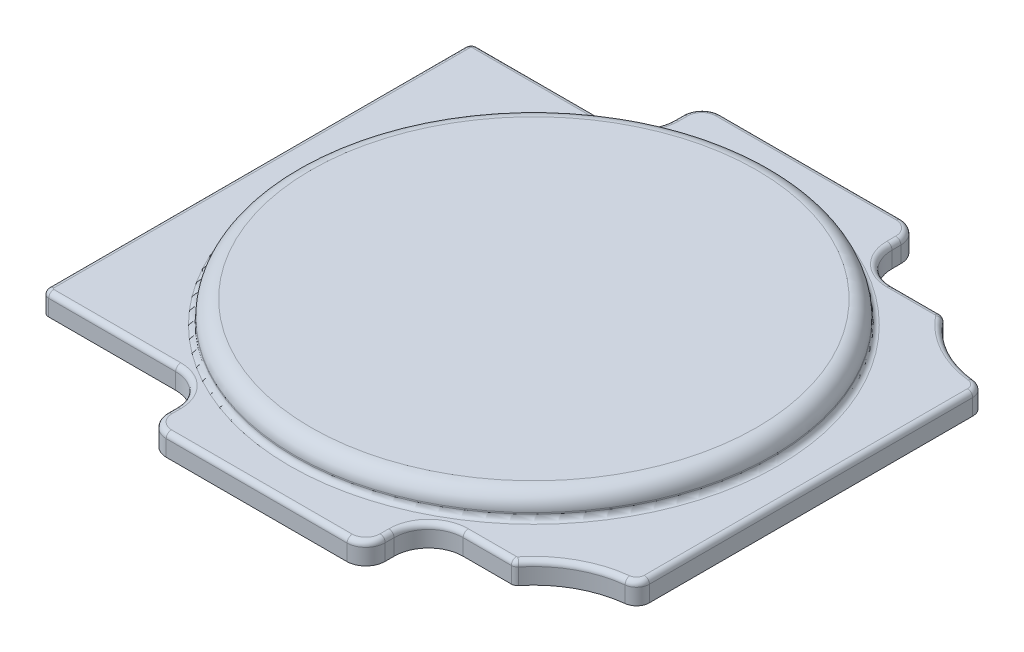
ISO-10303-21;
HEADER;
FILE_DESCRIPTION(('STEP AP214'),'2;1');
FILE_NAME('part.step','',(''),(''),'','','');
FILE_SCHEMA(('AUTOMOTIVE_DESIGN { 1 0 10303 214 1 1 1 1 }'));
ENDSEC;
DATA;
#1=APPLICATION_CONTEXT('core data for automotive mechanical design processes');
#2=APPLICATION_PROTOCOL_DEFINITION('international standard','automotive_design',2000,#1);
#3=PRODUCT_CONTEXT('',#1,'mechanical');
#4=PRODUCT('Part','Part','',(#3));
#5=PRODUCT_RELATED_PRODUCT_CATEGORY('part','',(#4));
#6=PRODUCT_DEFINITION_FORMATION('','',#4);
#7=PRODUCT_DEFINITION_CONTEXT('part definition',#1,'design');
#8=PRODUCT_DEFINITION('design','',#6,#7);
#9=PRODUCT_DEFINITION_SHAPE('','',#8);
#10=(LENGTH_UNIT() NAMED_UNIT(*) SI_UNIT(.MILLI.,.METRE.));
#11=(NAMED_UNIT(*) PLANE_ANGLE_UNIT() SI_UNIT($,.RADIAN.));
#12=(NAMED_UNIT(*) SI_UNIT($,.STERADIAN.) SOLID_ANGLE_UNIT());
#13=UNCERTAINTY_MEASURE_WITH_UNIT(LENGTH_MEASURE(1.E-05),#10,'distance_accuracy_value','');
#14=(GEOMETRIC_REPRESENTATION_CONTEXT(3) GLOBAL_UNCERTAINTY_ASSIGNED_CONTEXT((#13)) GLOBAL_UNIT_ASSIGNED_CONTEXT((#10,
#11,#12)) REPRESENTATION_CONTEXT('',''));
#15=CARTESIAN_POINT('',(0.,0.,0.));
#16=DIRECTION('',(0.,0.,1.));
#17=DIRECTION('',(1.,0.,0.));
#18=AXIS2_PLACEMENT_3D('',#15,#16,#17);
#19=CARTESIAN_POINT('',(42.9,6.,-42.9));
#20=DIRECTION('',(0.,0.,1.));
#21=DIRECTION('',(1.,0.,0.));
#22=AXIS2_PLACEMENT_3D('',#19,#20,#21);
#23=PLANE('',#22);
#24=DIRECTION('',(0.,1.,0.));
#25=VECTOR('',#24,1.);
#26=CARTESIAN_POINT('',(-14.,-0.794000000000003,-42.9));
#27=LINE('',#26,#25);
#28=CARTESIAN_POINT('',(-14.,-0.794000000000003,-42.9));
#29=VERTEX_POINT('',#28);
#30=CARTESIAN_POINT('',(-14.,1.7,-42.9));
#31=VERTEX_POINT('',#30);
#32=EDGE_CURVE('E288',#29,#31,#27,.T.);
#33=ORIENTED_EDGE('',*,*,#32,.T.);
#34=DIRECTION('',(-1.,0.,0.));
#35=VECTOR('',#34,1.);
#36=CARTESIAN_POINT('',(14.,1.7,-42.9));
#37=LINE('',#36,#35);
#38=CARTESIAN_POINT('',(14.,1.7,-42.9));
#39=VERTEX_POINT('',#38);
#40=EDGE_CURVE('E458',#31,#39,#37,.F.);
#41=ORIENTED_EDGE('',*,*,#40,.T.);
#42=DIRECTION('',(0.,1.,0.));
#43=VECTOR('',#42,1.);
#44=CARTESIAN_POINT('',(14.,-0.794000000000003,-42.9));
#45=LINE('',#44,#43);
#46=CARTESIAN_POINT('',(14.,-0.794000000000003,-42.9));
#47=VERTEX_POINT('',#46);
#48=EDGE_CURVE('E315',#47,#39,#45,.T.);
#49=ORIENTED_EDGE('',*,*,#48,.F.);
#50=DIRECTION('',(-1.,0.,0.));
#51=VECTOR('',#50,1.);
#52=CARTESIAN_POINT('',(42.9,-0.794,-42.9));
#53=LINE('',#52,#51);
#54=EDGE_CURVE('E307',#47,#29,#53,.T.);
#55=ORIENTED_EDGE('',*,*,#54,.T.);
#56=EDGE_LOOP('',(#33,#41,#49,#55));
#57=FACE_BOUND('',#56,.T.);
#58=ADVANCED_FACE('F17',(#57),#23,.F.);
#59=CARTESIAN_POINT('',(-42.9,6.,-42.9));
#60=DIRECTION('',(1.,0.,0.));
#61=DIRECTION('',(0.,0.,-1.));
#62=AXIS2_PLACEMENT_3D('',#59,#60,#61);
#63=PLANE('',#62);
#64=DIRECTION('',(0.,1.,0.));
#65=VECTOR('',#64,1.);
#66=CARTESIAN_POINT('',(-42.9,6.,32.18950173));
#67=LINE('',#66,#65);
#68=CARTESIAN_POINT('',(-42.9,-0.794,32.18950173));
#69=VERTEX_POINT('',#68);
#70=CARTESIAN_POINT('',(-42.9,1.7,32.18950173));
#71=VERTEX_POINT('',#70);
#72=EDGE_CURVE('E354',#69,#71,#67,.T.);
#73=ORIENTED_EDGE('',*,*,#72,.T.);
#74=DIRECTION('',(0.,0.,1.));
#75=VECTOR('',#74,1.);
#76=CARTESIAN_POINT('',(-42.9,1.7,-32.18950173));
#77=LINE('',#76,#75);
#78=CARTESIAN_POINT('',(-42.9,1.7,-32.18950173));
#79=VERTEX_POINT('',#78);
#80=EDGE_CURVE('E447',#71,#79,#77,.F.);
#81=ORIENTED_EDGE('',*,*,#80,.T.);
#82=DIRECTION('',(0.,1.,0.));
#83=VECTOR('',#82,1.);
#84=CARTESIAN_POINT('',(-42.9,-0.794,-32.18950173));
#85=LINE('',#84,#83);
#86=CARTESIAN_POINT('',(-42.9,-0.794,-32.18950173));
#87=VERTEX_POINT('',#86);
#88=EDGE_CURVE('E357',#79,#87,#85,.F.);
#89=ORIENTED_EDGE('',*,*,#88,.T.);
#90=DIRECTION('',(0.,0.,1.));
#91=VECTOR('',#90,1.);
#92=CARTESIAN_POINT('',(-42.9,-0.794,-42.9));
#93=LINE('',#92,#91);
#94=EDGE_CURVE('E316',#87,#69,#93,.T.);
#95=ORIENTED_EDGE('',*,*,#94,.T.);
#96=EDGE_LOOP('',(#73,#81,#89,#95));
#97=FACE_BOUND('',#96,.T.);
#98=ADVANCED_FACE('F497',(#97),#63,.F.);
#99=CARTESIAN_POINT('',(-42.9,6.,42.9));
#100=DIRECTION('',(0.,0.,-1.));
#101=DIRECTION('',(-1.,0.,0.));
#102=AXIS2_PLACEMENT_3D('',#99,#100,#101);
#103=PLANE('',#102);
#104=DIRECTION('',(0.,1.,0.));
#105=VECTOR('',#104,1.);
#106=CARTESIAN_POINT('',(14.,-0.794000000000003,42.9));
#107=LINE('',#106,#105);
#108=CARTESIAN_POINT('',(14.,-0.794000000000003,42.9));
#109=VERTEX_POINT('',#108);
#110=CARTESIAN_POINT('',(14.,1.7,42.9));
#111=VERTEX_POINT('',#110);
#112=EDGE_CURVE('E787',#109,#111,#107,.T.);
#113=ORIENTED_EDGE('',*,*,#112,.T.);
#114=DIRECTION('',(1.,0.,0.));
#115=VECTOR('',#114,1.);
#116=CARTESIAN_POINT('',(-14.,1.7,42.9));
#117=LINE('',#116,#115);
#118=CARTESIAN_POINT('',(-14.,1.7,42.9));
#119=VERTEX_POINT('',#118);
#120=EDGE_CURVE('E435',#111,#119,#117,.F.);
#121=ORIENTED_EDGE('',*,*,#120,.T.);
#122=DIRECTION('',(0.,1.,0.));
#123=VECTOR('',#122,1.);
#124=CARTESIAN_POINT('',(-14.,-0.794000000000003,42.9));
#125=LINE('',#124,#123);
#126=CARTESIAN_POINT('',(-14.,-0.794000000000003,42.9));
#127=VERTEX_POINT('',#126);
#128=EDGE_CURVE('E806',#127,#119,#125,.T.);
#129=ORIENTED_EDGE('',*,*,#128,.F.);
#130=DIRECTION('',(1.,0.,0.));
#131=VECTOR('',#130,1.);
#132=CARTESIAN_POINT('',(-42.9,-0.794,42.9));
#133=LINE('',#132,#131);
#134=EDGE_CURVE('E320',#127,#109,#133,.T.);
#135=ORIENTED_EDGE('',*,*,#134,.T.);
#136=EDGE_LOOP('',(#113,#121,#129,#135));
#137=FACE_BOUND('',#136,.T.);
#138=ADVANCED_FACE('F502',(#137),#103,.F.);
#139=CARTESIAN_POINT('',(42.9,6.,42.9));
#140=DIRECTION('',(-1.,0.,0.));
#141=DIRECTION('',(0.,0.,1.));
#142=AXIS2_PLACEMENT_3D('',#139,#140,#141);
#143=PLANE('',#142);
#144=DIRECTION('',(0.,1.,0.));
#145=VECTOR('',#144,1.);
#146=CARTESIAN_POINT('',(42.9,-0.794,-25.0114561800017));
#147=LINE('',#146,#145);
#148=CARTESIAN_POINT('',(42.9,-0.794,-25.0114561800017));
#149=VERTEX_POINT('',#148);
#150=CARTESIAN_POINT('',(42.9,1.7,-25.0114561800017));
#151=VERTEX_POINT('',#150);
#152=EDGE_CURVE('E834',#149,#151,#147,.T.);
#153=ORIENTED_EDGE('',*,*,#152,.T.);
#154=DIRECTION('',(0.,0.,-1.));
#155=VECTOR('',#154,1.);
#156=CARTESIAN_POINT('',(42.9,1.7,25.0114561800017));
#157=LINE('',#156,#155);
#158=CARTESIAN_POINT('',(42.9,1.7,25.0114561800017));
#159=VERTEX_POINT('',#158);
#160=EDGE_CURVE('E39',#151,#159,#157,.F.);
#161=ORIENTED_EDGE('',*,*,#160,.T.);
#162=DIRECTION('',(0.,1.,0.));
#163=VECTOR('',#162,1.);
#164=CARTESIAN_POINT('',(42.9,-0.794,25.0114561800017));
#165=LINE('',#164,#163);
#166=CARTESIAN_POINT('',(42.9,-0.794,25.0114561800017));
#167=VERTEX_POINT('',#166);
#168=EDGE_CURVE('E325',#167,#159,#165,.T.);
#169=ORIENTED_EDGE('',*,*,#168,.F.);
#170=DIRECTION('',(0.,0.,-1.));
#171=VECTOR('',#170,1.);
#172=CARTESIAN_POINT('',(42.9,-0.794,42.9));
#173=LINE('',#172,#171);
#174=EDGE_CURVE('E330',#167,#149,#173,.T.);
#175=ORIENTED_EDGE('',*,*,#174,.T.);
#176=EDGE_LOOP('',(#153,#161,#169,#175));
#177=FACE_BOUND('',#176,.T.);
#178=ADVANCED_FACE('F508',(#177),#143,.F.);
#179=CARTESIAN_POINT('',(40.9,-0.794,-25.0114561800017));
#180=DIRECTION('',(0.,1.,0.));
#181=DIRECTION('',(0.,0.,1.));
#182=AXIS2_PLACEMENT_3D('',#179,#180,#181);
#183=CYLINDRICAL_SURFACE('',#182,2.00000000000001);
#184=DIRECTION('',(0.,1.,0.));
#185=VECTOR('',#184,1.);
#186=CARTESIAN_POINT('',(41.1222222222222,-0.794,-26.9990721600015));
#187=LINE('',#186,#185);
#188=CARTESIAN_POINT('',(41.1222222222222,-0.794,-26.9990721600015));
#189=VERTEX_POINT('',#188);
#190=CARTESIAN_POINT('',(41.1222222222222,1.7,-26.9990721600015));
#191=VERTEX_POINT('',#190);
#192=EDGE_CURVE('E322',#189,#191,#187,.T.);
#193=ORIENTED_EDGE('',*,*,#192,.T.);
#194=CARTESIAN_POINT('',(40.9,1.7,-25.0114561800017));
#195=DIRECTION('',(0.,1.,0.));
#196=DIRECTION('',(0.,0.,1.));
#197=AXIS2_PLACEMENT_3D('',#194,#195,#196);
#198=CIRCLE('',#197,2.00000000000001);
#199=EDGE_CURVE('E472',#191,#151,#198,.F.);
#200=ORIENTED_EDGE('',*,*,#199,.T.);
#201=ORIENTED_EDGE('',*,*,#152,.F.);
#202=CARTESIAN_POINT('',(40.9,-0.794,-25.0114561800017));
#203=DIRECTION('',(0.,1.,0.));
#204=DIRECTION('',(0.,0.,-1.));
#205=AXIS2_PLACEMENT_3D('',#202,#203,#204);
#206=CIRCLE('',#205,2.00000000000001);
#207=EDGE_CURVE('E820',#149,#189,#206,.T.);
#208=ORIENTED_EDGE('',*,*,#207,.T.);
#209=EDGE_LOOP('',(#193,#200,#201,#208));
#210=FACE_BOUND('',#209,.T.);
#211=ADVANCED_FACE('F514',(#210),#183,.T.);
#212=CARTESIAN_POINT('',(42.9,-0.794,-42.9));
#213=DIRECTION('',(0.,1.,0.));
#214=DIRECTION('',(0.,0.,1.));
#215=AXIS2_PLACEMENT_3D('',#212,#213,#214);
#216=CYLINDRICAL_SURFACE('',#215,16.);
#217=DIRECTION('',(0.,1.,0.));
#218=VECTOR('',#217,1.);
#219=CARTESIAN_POINT('',(30.4748583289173,-0.794,-32.81953104));
#220=LINE('',#219,#218);
#221=CARTESIAN_POINT('',(30.4748583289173,-0.794,-32.81953104));
#222=VERTEX_POINT('',#221);
#223=CARTESIAN_POINT('',(30.4748583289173,1.7,-32.81953104));
#224=VERTEX_POINT('',#223);
#225=EDGE_CURVE('E343',#222,#224,#220,.T.);
#226=ORIENTED_EDGE('',*,*,#225,.T.);
#227=CARTESIAN_POINT('',(42.9,1.7,-42.9));
#228=DIRECTION('',(0.,1.,0.));
#229=DIRECTION('',(0.,0.,1.));
#230=AXIS2_PLACEMENT_3D('',#227,#228,#229);
#231=CIRCLE('',#230,16.);
#232=EDGE_CURVE('E470',#224,#191,#231,.T.);
#233=ORIENTED_EDGE('',*,*,#232,.T.);
#234=ORIENTED_EDGE('',*,*,#192,.F.);
#235=CARTESIAN_POINT('',(42.9,-0.794,-42.9));
#236=DIRECTION('',(0.,-1.,0.));
#237=DIRECTION('',(0.,0.,-1.));
#238=AXIS2_PLACEMENT_3D('',#235,#236,#237);
#239=CIRCLE('',#238,16.);
#240=EDGE_CURVE('E823',#189,#222,#239,.T.);
#241=ORIENTED_EDGE('',*,*,#240,.T.);
#242=EDGE_LOOP('',(#226,#233,#234,#241));
#243=FACE_BOUND('',#242,.T.);
#244=ADVANCED_FACE('F530',(#243),#216,.F.);
#245=CARTESIAN_POINT('',(-31.2146152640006,-0.794,-33.18950173));
#246=DIRECTION('',(0.,0.,-1.));
#247=DIRECTION('',(-1.,0.,0.));
#248=AXIS2_PLACEMENT_3D('',#245,#246,#247);
#249=PLANE('',#248);
#250=DIRECTION('',(0.,1.,0.));
#251=VECTOR('',#250,1.);
#252=CARTESIAN_POINT('',(-41.9,6.,-33.18950173));
#253=LINE('',#252,#251);
#254=CARTESIAN_POINT('',(-41.9,-0.794,-33.18950173));
#255=VERTEX_POINT('',#254);
#256=CARTESIAN_POINT('',(-41.9,1.7,-33.18950173));
#257=VERTEX_POINT('',#256);
#258=EDGE_CURVE('E351',#255,#257,#253,.T.);
#259=ORIENTED_EDGE('',*,*,#258,.T.);
#260=DIRECTION('',(1.,0.,0.));
#261=VECTOR('',#260,1.);
#262=CARTESIAN_POINT('',(-31.2146152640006,1.7,-33.18950173));
#263=LINE('',#262,#261);
#264=CARTESIAN_POINT('',(-22.25,1.7,-33.18950173));
#265=VERTEX_POINT('',#264);
#266=EDGE_CURVE('E451',#257,#265,#263,.T.);
#267=ORIENTED_EDGE('',*,*,#266,.T.);
#268=DIRECTION('',(0.,1.,0.));
#269=VECTOR('',#268,1.);
#270=CARTESIAN_POINT('',(-22.25,-0.794000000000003,-33.18950173));
#271=LINE('',#270,#269);
#272=CARTESIAN_POINT('',(-22.25,-0.794000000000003,-33.18950173));
#273=VERTEX_POINT('',#272);
#274=EDGE_CURVE('E299',#273,#265,#271,.T.);
#275=ORIENTED_EDGE('',*,*,#274,.F.);
#276=DIRECTION('',(-1.,0.,0.));
#277=VECTOR('',#276,1.);
#278=CARTESIAN_POINT('',(-31.2146152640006,-0.794,-33.18950173));
#279=LINE('',#278,#277);
#280=EDGE_CURVE('E826',#273,#255,#279,.T.);
#281=ORIENTED_EDGE('',*,*,#280,.T.);
#282=EDGE_LOOP('',(#259,#267,#275,#281));
#283=FACE_BOUND('',#282,.T.);
#284=ADVANCED_FACE('F534',(#283),#249,.T.);
#285=CARTESIAN_POINT('',(-31.2146152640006,-0.794,33.18950173));
#286=DIRECTION('',(0.,0.,1.));
#287=DIRECTION('',(1.,0.,0.));
#288=AXIS2_PLACEMENT_3D('',#285,#286,#287);
#289=PLANE('',#288);
#290=DIRECTION('',(0.,1.,0.));
#291=VECTOR('',#290,1.);
#292=CARTESIAN_POINT('',(-22.25,-0.794000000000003,33.18950173));
#293=LINE('',#292,#291);
#294=CARTESIAN_POINT('',(-22.25,-0.794000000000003,33.18950173));
#295=VERTEX_POINT('',#294);
#296=CARTESIAN_POINT('',(-22.25,1.7,33.18950173));
#297=VERTEX_POINT('',#296);
#298=EDGE_CURVE('E807',#295,#297,#293,.T.);
#299=ORIENTED_EDGE('',*,*,#298,.T.);
#300=DIRECTION('',(-1.,0.,0.));
#301=VECTOR('',#300,1.);
#302=CARTESIAN_POINT('',(-31.2146152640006,1.7,33.18950173));
#303=LINE('',#302,#301);
#304=CARTESIAN_POINT('',(-41.9,1.7,33.18950173));
#305=VERTEX_POINT('',#304);
#306=EDGE_CURVE('E443',#297,#305,#303,.T.);
#307=ORIENTED_EDGE('',*,*,#306,.T.);
#308=DIRECTION('',(0.,1.,0.));
#309=VECTOR('',#308,1.);
#310=CARTESIAN_POINT('',(-41.9,-0.794,33.18950173));
#311=LINE('',#310,#309);
#312=CARTESIAN_POINT('',(-41.9,-0.794,33.18950173));
#313=VERTEX_POINT('',#312);
#314=EDGE_CURVE('E359',#305,#313,#311,.F.);
#315=ORIENTED_EDGE('',*,*,#314,.T.);
#316=DIRECTION('',(1.,0.,0.));
#317=VECTOR('',#316,1.);
#318=CARTESIAN_POINT('',(-31.2146152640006,-0.794,33.18950173));
#319=LINE('',#318,#317);
#320=EDGE_CURVE('E829',#313,#295,#319,.T.);
#321=ORIENTED_EDGE('',*,*,#320,.T.);
#322=EDGE_LOOP('',(#299,#307,#315,#321));
#323=FACE_BOUND('',#322,.T.);
#324=ADVANCED_FACE('F527',(#323),#289,.T.);
#325=CARTESIAN_POINT('',(40.9,-0.794,25.0114561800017));
#326=DIRECTION('',(0.,1.,0.));
#327=DIRECTION('',(0.,0.,1.));
#328=AXIS2_PLACEMENT_3D('',#325,#326,#327);
#329=CYLINDRICAL_SURFACE('',#328,2.00000000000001);
#330=ORIENTED_EDGE('',*,*,#168,.T.);
#331=CARTESIAN_POINT('',(40.9,1.7,25.0114561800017));
#332=DIRECTION('',(0.,1.,0.));
#333=DIRECTION('',(0.,0.,1.));
#334=AXIS2_PLACEMENT_3D('',#331,#332,#333);
#335=CIRCLE('',#334,2.00000000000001);
#336=CARTESIAN_POINT('',(41.1222222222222,1.7,26.9990721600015));
#337=VERTEX_POINT('',#336);
#338=EDGE_CURVE('E31',#159,#337,#335,.F.);
#339=ORIENTED_EDGE('',*,*,#338,.T.);
#340=DIRECTION('',(0.,1.,0.));
#341=VECTOR('',#340,1.);
#342=CARTESIAN_POINT('',(41.1222222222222,-0.794,26.9990721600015));
#343=LINE('',#342,#341);
#344=CARTESIAN_POINT('',(41.1222222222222,-0.794,26.9990721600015));
#345=VERTEX_POINT('',#344);
#346=EDGE_CURVE('E317',#345,#337,#343,.T.);
#347=ORIENTED_EDGE('',*,*,#346,.F.);
#348=CARTESIAN_POINT('',(40.9,-0.794,25.0114561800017));
#349=DIRECTION('',(0.,1.,0.));
#350=DIRECTION('',(0.,0.,1.));
#351=AXIS2_PLACEMENT_3D('',#348,#349,#350);
#352=CIRCLE('',#351,2.00000000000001);
#353=EDGE_CURVE('E810',#345,#167,#352,.T.);
#354=ORIENTED_EDGE('',*,*,#353,.T.);
#355=EDGE_LOOP('',(#330,#339,#347,#354));
#356=FACE_BOUND('',#355,.T.);
#357=ADVANCED_FACE('F523',(#356),#329,.T.);
#358=CARTESIAN_POINT('',(42.9,-0.794,42.9));
#359=DIRECTION('',(0.,1.,0.));
#360=DIRECTION('',(0.,0.,1.));
#361=AXIS2_PLACEMENT_3D('',#358,#359,#360);
#362=CYLINDRICAL_SURFACE('',#361,16.);
#363=ORIENTED_EDGE('',*,*,#346,.T.);
#364=CARTESIAN_POINT('',(42.9,1.7,42.9));
#365=DIRECTION('',(0.,1.,0.));
#366=DIRECTION('',(0.,0.,1.));
#367=AXIS2_PLACEMENT_3D('',#364,#365,#366);
#368=CIRCLE('',#367,16.);
#369=CARTESIAN_POINT('',(30.4748583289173,1.7,32.81953104));
#370=VERTEX_POINT('',#369);
#371=EDGE_CURVE('E476',#337,#370,#368,.T.);
#372=ORIENTED_EDGE('',*,*,#371,.T.);
#373=DIRECTION('',(0.,1.,0.));
#374=VECTOR('',#373,1.);
#375=CARTESIAN_POINT('',(30.4748583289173,-0.794,32.81953104));
#376=LINE('',#375,#374);
#377=CARTESIAN_POINT('',(30.4748583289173,-0.794,32.81953104));
#378=VERTEX_POINT('',#377);
#379=EDGE_CURVE('E349',#370,#378,#376,.F.);
#380=ORIENTED_EDGE('',*,*,#379,.T.);
#381=CARTESIAN_POINT('',(42.9,-0.794,42.9));
#382=DIRECTION('',(0.,-1.,0.));
#383=DIRECTION('',(0.,0.,1.));
#384=AXIS2_PLACEMENT_3D('',#381,#382,#383);
#385=CIRCLE('',#384,16.);
#386=EDGE_CURVE('E831',#378,#345,#385,.T.);
#387=ORIENTED_EDGE('',*,*,#386,.T.);
#388=EDGE_LOOP('',(#363,#372,#380,#387));
#389=FACE_BOUND('',#388,.T.);
#390=ADVANCED_FACE('F526',(#389),#362,.F.);
#391=CARTESIAN_POINT('',(-22.25,-0.794000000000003,38.5381304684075));
#392=DIRECTION('',(0.,1.,0.));
#393=DIRECTION('',(0.,0.,1.));
#394=AXIS2_PLACEMENT_3D('',#391,#392,#393);
#395=CYLINDRICAL_SURFACE('',#394,5.34862873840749);
#396=DIRECTION('',(0.,1.,0.));
#397=VECTOR('',#396,1.);
#398=CARTESIAN_POINT('',(-16.9013712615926,-0.794000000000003,38.5381304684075));
#399=LINE('',#398,#397);
#400=CARTESIAN_POINT('',(-16.9013712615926,-0.794000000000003,38.5381304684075));
#401=VERTEX_POINT('',#400);
#402=CARTESIAN_POINT('',(-16.9013712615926,1.7,38.5381304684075));
#403=VERTEX_POINT('',#402);
#404=EDGE_CURVE('E811',#401,#403,#399,.T.);
#405=ORIENTED_EDGE('',*,*,#404,.T.);
#406=CARTESIAN_POINT('',(-22.25,1.7,38.5381304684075));
#407=DIRECTION('',(0.,1.,0.));
#408=DIRECTION('',(0.,0.,1.));
#409=AXIS2_PLACEMENT_3D('',#406,#407,#408);
#410=CIRCLE('',#409,5.34862873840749);
#411=EDGE_CURVE('E441',#403,#297,#410,.T.);
#412=ORIENTED_EDGE('',*,*,#411,.T.);
#413=ORIENTED_EDGE('',*,*,#298,.F.);
#414=CARTESIAN_POINT('',(-22.25,-0.794000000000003,38.5381304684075));
#415=DIRECTION('',(0.,1.,0.));
#416=DIRECTION('',(0.,0.,1.));
#417=AXIS2_PLACEMENT_3D('',#414,#415,#416);
#418=CIRCLE('',#417,5.34862873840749);
#419=EDGE_CURVE('E803',#401,#295,#418,.T.);
#420=ORIENTED_EDGE('',*,*,#419,.F.);
#421=EDGE_LOOP('',(#405,#412,#413,#420));
#422=FACE_BOUND('',#421,.T.);
#423=ADVANCED_FACE('F544',(#422),#395,.F.);
#424=CARTESIAN_POINT('',(-16.9013712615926,-0.794000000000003,38.5381304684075));
#425=DIRECTION('',(1.,0.,0.));
#426=DIRECTION('',(0.,0.,-1.));
#427=AXIS2_PLACEMENT_3D('',#424,#425,#426);
#428=PLANE('',#427);
#429=DIRECTION('',(0.,1.,0.));
#430=VECTOR('',#429,1.);
#431=CARTESIAN_POINT('',(-16.9013712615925,-0.794000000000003,39.9016217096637));
#432=LINE('',#431,#430);
#433=CARTESIAN_POINT('',(-16.9013712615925,-0.794000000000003,39.9016217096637));
#434=VERTEX_POINT('',#433);
#435=CARTESIAN_POINT('',(-16.9013712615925,1.7,39.9016217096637));
#436=VERTEX_POINT('',#435);
#437=EDGE_CURVE('E814',#434,#436,#432,.T.);
#438=ORIENTED_EDGE('',*,*,#437,.T.);
#439=DIRECTION('',(0.,0.,1.));
#440=VECTOR('',#439,1.);
#441=CARTESIAN_POINT('',(-16.9013712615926,1.7,38.5381304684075));
#442=LINE('',#441,#440);
#443=EDGE_CURVE('E439',#436,#403,#442,.F.);
#444=ORIENTED_EDGE('',*,*,#443,.T.);
#445=ORIENTED_EDGE('',*,*,#404,.F.);
#446=DIRECTION('',(0.,0.,-1.));
#447=VECTOR('',#446,1.);
#448=CARTESIAN_POINT('',(-16.9013712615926,-0.794000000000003,38.5381304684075));
#449=LINE('',#448,#447);
#450=EDGE_CURVE('E800',#434,#401,#449,.T.);
#451=ORIENTED_EDGE('',*,*,#450,.F.);
#452=EDGE_LOOP('',(#438,#444,#445,#451));
#453=FACE_BOUND('',#452,.T.);
#454=ADVANCED_FACE('F550',(#453),#428,.F.);
#455=CARTESIAN_POINT('',(-13.9013712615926,-0.794000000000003,39.9016217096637));
#456=DIRECTION('',(0.,1.,0.));
#457=DIRECTION('',(0.,0.,1.));
#458=AXIS2_PLACEMENT_3D('',#455,#456,#457);
#459=CYLINDRICAL_SURFACE('',#458,3.);
#460=ORIENTED_EDGE('',*,*,#128,.T.);
#461=CARTESIAN_POINT('',(-13.9013712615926,1.7,39.9016217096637));
#462=DIRECTION('',(0.,1.,0.));
#463=DIRECTION('',(0.,0.,1.));
#464=AXIS2_PLACEMENT_3D('',#461,#462,#463);
#465=CIRCLE('',#464,3.);
#466=EDGE_CURVE('E437',#119,#436,#465,.F.);
#467=ORIENTED_EDGE('',*,*,#466,.T.);
#468=ORIENTED_EDGE('',*,*,#437,.F.);
#469=CARTESIAN_POINT('',(-13.9013712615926,-0.794000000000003,39.9016217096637));
#470=DIRECTION('',(0.,-1.,0.));
#471=DIRECTION('',(0.,0.,1.));
#472=AXIS2_PLACEMENT_3D('',#469,#470,#471);
#473=CIRCLE('',#472,3.);
#474=EDGE_CURVE('E791',#127,#434,#473,.T.);
#475=ORIENTED_EDGE('',*,*,#474,.F.);
#476=EDGE_LOOP('',(#460,#467,#468,#475));
#477=FACE_BOUND('',#476,.T.);
#478=ADVANCED_FACE('F546',(#477),#459,.T.);
#479=CARTESIAN_POINT('',(13.9013712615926,-0.794000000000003,39.9016217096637));
#480=DIRECTION('',(0.,1.,0.));
#481=DIRECTION('',(0.,0.,1.));
#482=AXIS2_PLACEMENT_3D('',#479,#480,#481);
#483=CYLINDRICAL_SURFACE('',#482,3.);
#484=DIRECTION('',(0.,1.,0.));
#485=VECTOR('',#484,1.);
#486=CARTESIAN_POINT('',(16.9013712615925,-0.794000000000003,39.9016217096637));
#487=LINE('',#486,#485);
#488=CARTESIAN_POINT('',(16.9013712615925,-0.794000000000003,39.9016217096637));
#489=VERTEX_POINT('',#488);
#490=CARTESIAN_POINT('',(16.9013712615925,1.7,39.9016217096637));
#491=VERTEX_POINT('',#490);
#492=EDGE_CURVE('E788',#489,#491,#487,.T.);
#493=ORIENTED_EDGE('',*,*,#492,.T.);
#494=CARTESIAN_POINT('',(13.9013712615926,1.7,39.9016217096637));
#495=DIRECTION('',(0.,1.,0.));
#496=DIRECTION('',(0.,0.,1.));
#497=AXIS2_PLACEMENT_3D('',#494,#495,#496);
#498=CIRCLE('',#497,3.);
#499=EDGE_CURVE('E433',#491,#111,#498,.F.);
#500=ORIENTED_EDGE('',*,*,#499,.T.);
#501=ORIENTED_EDGE('',*,*,#112,.F.);
#502=CARTESIAN_POINT('',(13.9013712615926,-0.794000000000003,39.9016217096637));
#503=DIRECTION('',(0.,-1.,0.));
#504=DIRECTION('',(0.,0.,-1.));
#505=AXIS2_PLACEMENT_3D('',#502,#503,#504);
#506=CIRCLE('',#505,3.);
#507=EDGE_CURVE('E776',#489,#109,#506,.T.);
#508=ORIENTED_EDGE('',*,*,#507,.F.);
#509=EDGE_LOOP('',(#493,#500,#501,#508));
#510=FACE_BOUND('',#509,.T.);
#511=ADVANCED_FACE('F549',(#510),#483,.T.);
#512=CARTESIAN_POINT('',(16.9013712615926,-0.794000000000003,38.5381304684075));
#513=DIRECTION('',(-1.,0.,0.));
#514=DIRECTION('',(0.,0.,1.));
#515=AXIS2_PLACEMENT_3D('',#512,#513,#514);
#516=PLANE('',#515);
#517=DIRECTION('',(0.,1.,0.));
#518=VECTOR('',#517,1.);
#519=CARTESIAN_POINT('',(16.9013712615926,-0.794000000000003,38.5381304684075));
#520=LINE('',#519,#518);
#521=CARTESIAN_POINT('',(16.9013712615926,-0.794000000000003,38.5381304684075));
#522=VERTEX_POINT('',#521);
#523=CARTESIAN_POINT('',(16.9013712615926,1.7,38.5381304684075));
#524=VERTEX_POINT('',#523);
#525=EDGE_CURVE('E792',#522,#524,#520,.T.);
#526=ORIENTED_EDGE('',*,*,#525,.T.);
#527=DIRECTION('',(0.,0.,-1.));
#528=VECTOR('',#527,1.);
#529=CARTESIAN_POINT('',(16.9013712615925,1.7,39.9016217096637));
#530=LINE('',#529,#528);
#531=EDGE_CURVE('E431',#524,#491,#530,.F.);
#532=ORIENTED_EDGE('',*,*,#531,.T.);
#533=ORIENTED_EDGE('',*,*,#492,.F.);
#534=DIRECTION('',(0.,0.,1.));
#535=VECTOR('',#534,1.);
#536=CARTESIAN_POINT('',(16.9013712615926,-0.794000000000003,38.5381304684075));
#537=LINE('',#536,#535);
#538=EDGE_CURVE('E778',#522,#489,#537,.T.);
#539=ORIENTED_EDGE('',*,*,#538,.F.);
#540=EDGE_LOOP('',(#526,#532,#533,#539));
#541=FACE_BOUND('',#540,.T.);
#542=ADVANCED_FACE('F560',(#541),#516,.F.);
#543=CARTESIAN_POINT('',(22.25,-0.794000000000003,38.5381304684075));
#544=DIRECTION('',(0.,1.,0.));
#545=DIRECTION('',(0.,0.,1.));
#546=AXIS2_PLACEMENT_3D('',#543,#544,#545);
#547=CYLINDRICAL_SURFACE('',#546,5.34862873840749);
#548=DIRECTION('',(0.,1.,0.));
#549=VECTOR('',#548,1.);
#550=CARTESIAN_POINT('',(22.25,-0.794000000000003,33.18950173));
#551=LINE('',#550,#549);
#552=CARTESIAN_POINT('',(22.25,-0.794000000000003,33.18950173));
#553=VERTEX_POINT('',#552);
#554=CARTESIAN_POINT('',(22.25,1.7,33.18950173));
#555=VERTEX_POINT('',#554);
#556=EDGE_CURVE('E772',#553,#555,#551,.T.);
#557=ORIENTED_EDGE('',*,*,#556,.T.);
#558=CARTESIAN_POINT('',(22.25,1.7,38.5381304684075));
#559=DIRECTION('',(0.,1.,0.));
#560=DIRECTION('',(0.,0.,1.));
#561=AXIS2_PLACEMENT_3D('',#558,#559,#560);
#562=CIRCLE('',#561,5.34862873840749);
#563=EDGE_CURVE('E429',#555,#524,#562,.T.);
#564=ORIENTED_EDGE('',*,*,#563,.T.);
#565=ORIENTED_EDGE('',*,*,#525,.F.);
#566=CARTESIAN_POINT('',(22.25,-0.794000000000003,38.5381304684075));
#567=DIRECTION('',(0.,1.,0.));
#568=DIRECTION('',(0.,0.,-1.));
#569=AXIS2_PLACEMENT_3D('',#566,#567,#568);
#570=CIRCLE('',#569,5.34862873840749);
#571=EDGE_CURVE('E775',#553,#522,#570,.T.);
#572=ORIENTED_EDGE('',*,*,#571,.F.);
#573=EDGE_LOOP('',(#557,#564,#565,#572));
#574=FACE_BOUND('',#573,.T.);
#575=ADVANCED_FACE('F566',(#574),#547,.F.);
#576=CARTESIAN_POINT('',(34.4508462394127,-0.794000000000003,33.18950173));
#577=DIRECTION('',(0.,0.,-1.));
#578=DIRECTION('',(-1.,0.,0.));
#579=AXIS2_PLACEMENT_3D('',#576,#577,#578);
#580=PLANE('',#579);
#581=DIRECTION('',(0.,-1.,0.));
#582=VECTOR('',#581,1.);
#583=CARTESIAN_POINT('',(29.6982869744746,6.,33.18950173));
#584=LINE('',#583,#582);
#585=CARTESIAN_POINT('',(29.6982869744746,-0.794000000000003,33.18950173));
#586=VERTEX_POINT('',#585);
#587=CARTESIAN_POINT('',(29.6982869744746,1.7,33.18950173));
#588=VERTEX_POINT('',#587);
#589=EDGE_CURVE('E346',#586,#588,#584,.F.);
#590=ORIENTED_EDGE('',*,*,#589,.T.);
#591=DIRECTION('',(1.,0.,0.));
#592=VECTOR('',#591,1.);
#593=CARTESIAN_POINT('',(22.25,1.7,33.18950173));
#594=LINE('',#593,#592);
#595=EDGE_CURVE('E427',#588,#555,#594,.F.);
#596=ORIENTED_EDGE('',*,*,#595,.T.);
#597=ORIENTED_EDGE('',*,*,#556,.F.);
#598=DIRECTION('',(-1.,0.,0.));
#599=VECTOR('',#598,1.);
#600=CARTESIAN_POINT('',(34.4508462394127,-0.794000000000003,33.18950173));
#601=LINE('',#600,#599);
#602=EDGE_CURVE('E771',#586,#553,#601,.T.);
#603=ORIENTED_EDGE('',*,*,#602,.F.);
#604=EDGE_LOOP('',(#590,#596,#597,#603));
#605=FACE_BOUND('',#604,.T.);
#606=ADVANCED_FACE('F562',(#605),#580,.F.);
#607=CARTESIAN_POINT('',(22.25,-0.794000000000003,-38.5381304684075));
#608=DIRECTION('',(0.,1.,0.));
#609=DIRECTION('',(0.,0.,1.));
#610=AXIS2_PLACEMENT_3D('',#607,#608,#609);
#611=CYLINDRICAL_SURFACE('',#610,5.34862873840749);
#612=DIRECTION('',(0.,1.,0.));
#613=VECTOR('',#612,1.);
#614=CARTESIAN_POINT('',(16.9013712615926,-0.794000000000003,-38.5381304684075));
#615=LINE('',#614,#613);
#616=CARTESIAN_POINT('',(16.9013712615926,-0.794000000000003,-38.5381304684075));
#617=VERTEX_POINT('',#616);
#618=CARTESIAN_POINT('',(16.9013712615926,1.7,-38.5381304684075));
#619=VERTEX_POINT('',#618);
#620=EDGE_CURVE('E781',#617,#619,#615,.T.);
#621=ORIENTED_EDGE('',*,*,#620,.T.);
#622=CARTESIAN_POINT('',(22.25,1.7,-38.5381304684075));
#623=DIRECTION('',(0.,1.,0.));
#624=DIRECTION('',(0.,0.,1.));
#625=AXIS2_PLACEMENT_3D('',#622,#623,#624);
#626=CIRCLE('',#625,5.34862873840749);
#627=CARTESIAN_POINT('',(22.25,1.7,-33.18950173));
#628=VERTEX_POINT('',#627);
#629=EDGE_CURVE('E464',#619,#628,#626,.T.);
#630=ORIENTED_EDGE('',*,*,#629,.T.);
#631=DIRECTION('',(0.,1.,0.));
#632=VECTOR('',#631,1.);
#633=CARTESIAN_POINT('',(22.25,-0.794000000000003,-33.18950173));
#634=LINE('',#633,#632);
#635=CARTESIAN_POINT('',(22.25,-0.794000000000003,-33.18950173));
#636=VERTEX_POINT('',#635);
#637=EDGE_CURVE('E922',#636,#628,#634,.T.);
#638=ORIENTED_EDGE('',*,*,#637,.F.);
#639=CARTESIAN_POINT('',(22.25,-0.794000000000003,-38.5381304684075));
#640=DIRECTION('',(0.,1.,0.));
#641=DIRECTION('',(0.,0.,1.));
#642=AXIS2_PLACEMENT_3D('',#639,#640,#641);
#643=CIRCLE('',#642,5.34862873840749);
#644=EDGE_CURVE('E907',#617,#636,#643,.T.);
#645=ORIENTED_EDGE('',*,*,#644,.F.);
#646=EDGE_LOOP('',(#621,#630,#638,#645));
#647=FACE_BOUND('',#646,.T.);
#648=ADVANCED_FACE('F565',(#647),#611,.F.);
#649=CARTESIAN_POINT('',(16.9013712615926,-0.794000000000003,-38.5381304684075));
#650=DIRECTION('',(-1.,0.,0.));
#651=DIRECTION('',(0.,0.,1.));
#652=AXIS2_PLACEMENT_3D('',#649,#650,#651);
#653=PLANE('',#652);
#654=DIRECTION('',(0.,1.,0.));
#655=VECTOR('',#654,1.);
#656=CARTESIAN_POINT('',(16.9013712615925,-0.794000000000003,-39.9016217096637));
#657=LINE('',#656,#655);
#658=CARTESIAN_POINT('',(16.9013712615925,-0.794000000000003,-39.9016217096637));
#659=VERTEX_POINT('',#658);
#660=CARTESIAN_POINT('',(16.9013712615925,1.7,-39.9016217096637));
#661=VERTEX_POINT('',#660);
#662=EDGE_CURVE('E925',#659,#661,#657,.T.);
#663=ORIENTED_EDGE('',*,*,#662,.T.);
#664=DIRECTION('',(0.,0.,-1.));
#665=VECTOR('',#664,1.);
#666=CARTESIAN_POINT('',(16.9013712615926,1.7,-38.5381304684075));
#667=LINE('',#666,#665);
#668=EDGE_CURVE('E462',#661,#619,#667,.F.);
#669=ORIENTED_EDGE('',*,*,#668,.T.);
#670=ORIENTED_EDGE('',*,*,#620,.F.);
#671=DIRECTION('',(0.,0.,1.));
#672=VECTOR('',#671,1.);
#673=CARTESIAN_POINT('',(16.9013712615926,-0.794000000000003,-38.5381304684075));
#674=LINE('',#673,#672);
#675=EDGE_CURVE('E919',#659,#617,#674,.T.);
#676=ORIENTED_EDGE('',*,*,#675,.F.);
#677=EDGE_LOOP('',(#663,#669,#670,#676));
#678=FACE_BOUND('',#677,.T.);
#679=ADVANCED_FACE('F576',(#678),#653,.F.);
#680=CARTESIAN_POINT('',(13.9013712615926,-0.794000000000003,-39.9016217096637));
#681=DIRECTION('',(0.,1.,0.));
#682=DIRECTION('',(0.,0.,1.));
#683=AXIS2_PLACEMENT_3D('',#680,#681,#682);
#684=CYLINDRICAL_SURFACE('',#683,3.);
#685=ORIENTED_EDGE('',*,*,#48,.T.);
#686=CARTESIAN_POINT('',(13.9013712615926,1.7,-39.9016217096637));
#687=DIRECTION('',(0.,1.,0.));
#688=DIRECTION('',(0.,0.,1.));
#689=AXIS2_PLACEMENT_3D('',#686,#687,#688);
#690=CIRCLE('',#689,3.);
#691=EDGE_CURVE('E460',#39,#661,#690,.F.);
#692=ORIENTED_EDGE('',*,*,#691,.T.);
#693=ORIENTED_EDGE('',*,*,#662,.F.);
#694=CARTESIAN_POINT('',(13.9013712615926,-0.794000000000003,-39.9016217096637));
#695=DIRECTION('',(0.,-1.,0.));
#696=DIRECTION('',(0.,0.,1.));
#697=AXIS2_PLACEMENT_3D('',#694,#695,#696);
#698=CIRCLE('',#697,3.);
#699=EDGE_CURVE('E917',#47,#659,#698,.T.);
#700=ORIENTED_EDGE('',*,*,#699,.F.);
#701=EDGE_LOOP('',(#685,#692,#693,#700));
#702=FACE_BOUND('',#701,.T.);
#703=ADVANCED_FACE('F581',(#702),#684,.T.);
#704=CARTESIAN_POINT('',(34.4508462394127,-0.794000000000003,-33.18950173));
#705=DIRECTION('',(0.,0.,1.));
#706=DIRECTION('',(1.,0.,0.));
#707=AXIS2_PLACEMENT_3D('',#704,#705,#706);
#708=PLANE('',#707);
#709=ORIENTED_EDGE('',*,*,#637,.T.);
#710=DIRECTION('',(-1.,0.,0.));
#711=VECTOR('',#710,1.);
#712=CARTESIAN_POINT('',(29.6982869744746,1.7,-33.18950173));
#713=LINE('',#712,#711);
#714=CARTESIAN_POINT('',(29.6982869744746,1.7,-33.18950173));
#715=VERTEX_POINT('',#714);
#716=EDGE_CURVE('E466',#628,#715,#713,.F.);
#717=ORIENTED_EDGE('',*,*,#716,.T.);
#718=DIRECTION('',(0.,-1.,0.));
#719=VECTOR('',#718,1.);
#720=CARTESIAN_POINT('',(29.6982869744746,-0.794000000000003,-33.18950173));
#721=LINE('',#720,#719);
#722=CARTESIAN_POINT('',(29.6982869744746,-0.794000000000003,-33.18950173));
#723=VERTEX_POINT('',#722);
#724=EDGE_CURVE('E333',#715,#723,#721,.T.);
#725=ORIENTED_EDGE('',*,*,#724,.T.);
#726=DIRECTION('',(1.,0.,0.));
#727=VECTOR('',#726,1.);
#728=CARTESIAN_POINT('',(34.4508462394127,-0.794000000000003,-33.18950173));
#729=LINE('',#728,#727);
#730=EDGE_CURVE('E915',#636,#723,#729,.T.);
#731=ORIENTED_EDGE('',*,*,#730,.F.);
#732=EDGE_LOOP('',(#709,#717,#725,#731));
#733=FACE_BOUND('',#732,.T.);
#734=ADVANCED_FACE('F578',(#733),#708,.F.);
#735=CARTESIAN_POINT('',(-13.9013712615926,-0.794000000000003,-39.9016217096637));
#736=DIRECTION('',(0.,1.,0.));
#737=DIRECTION('',(0.,0.,1.));
#738=AXIS2_PLACEMENT_3D('',#735,#736,#737);
#739=CYLINDRICAL_SURFACE('',#738,3.);
#740=DIRECTION('',(0.,1.,0.));
#741=VECTOR('',#740,1.);
#742=CARTESIAN_POINT('',(-16.9013712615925,-0.794000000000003,-39.9016217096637));
#743=LINE('',#742,#741);
#744=CARTESIAN_POINT('',(-16.9013712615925,-0.794000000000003,-39.9016217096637));
#745=VERTEX_POINT('',#744);
#746=CARTESIAN_POINT('',(-16.9013712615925,1.7,-39.9016217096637));
#747=VERTEX_POINT('',#746);
#748=EDGE_CURVE('E905',#745,#747,#743,.T.);
#749=ORIENTED_EDGE('',*,*,#748,.T.);
#750=CARTESIAN_POINT('',(-13.9013712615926,1.7,-39.9016217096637));
#751=DIRECTION('',(0.,1.,0.));
#752=DIRECTION('',(0.,0.,1.));
#753=AXIS2_PLACEMENT_3D('',#750,#751,#752);
#754=CIRCLE('',#753,3.);
#755=EDGE_CURVE('E295',#747,#31,#754,.F.);
#756=ORIENTED_EDGE('',*,*,#755,.T.);
#757=ORIENTED_EDGE('',*,*,#32,.F.);
#758=CARTESIAN_POINT('',(-13.9013712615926,-0.794000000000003,-39.9016217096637));
#759=DIRECTION('',(0.,-1.,0.));
#760=DIRECTION('',(0.,0.,-1.));
#761=AXIS2_PLACEMENT_3D('',#758,#759,#760);
#762=CIRCLE('',#761,3.);
#763=EDGE_CURVE('E292',#745,#29,#762,.T.);
#764=ORIENTED_EDGE('',*,*,#763,.F.);
#765=EDGE_LOOP('',(#749,#756,#757,#764));
#766=FACE_BOUND('',#765,.T.);
#767=ADVANCED_FACE('F291',(#766),#739,.T.);
#768=CARTESIAN_POINT('',(-16.9013712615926,-0.794000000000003,-38.5381304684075));
#769=DIRECTION('',(1.,0.,0.));
#770=DIRECTION('',(0.,0.,-1.));
#771=AXIS2_PLACEMENT_3D('',#768,#769,#770);
#772=PLANE('',#771);
#773=DIRECTION('',(0.,1.,0.));
#774=VECTOR('',#773,1.);
#775=CARTESIAN_POINT('',(-16.9013712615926,-0.794000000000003,-38.5381304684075));
#776=LINE('',#775,#774);
#777=CARTESIAN_POINT('',(-16.9013712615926,-0.794000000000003,-38.5381304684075));
#778=VERTEX_POINT('',#777);
#779=CARTESIAN_POINT('',(-16.9013712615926,1.7,-38.5381304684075));
#780=VERTEX_POINT('',#779);
#781=EDGE_CURVE('E908',#778,#780,#776,.T.);
#782=ORIENTED_EDGE('',*,*,#781,.T.);
#783=DIRECTION('',(0.,0.,1.));
#784=VECTOR('',#783,1.);
#785=CARTESIAN_POINT('',(-16.9013712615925,1.7,-39.9016217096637));
#786=LINE('',#785,#784);
#787=EDGE_CURVE('E455',#780,#747,#786,.F.);
#788=ORIENTED_EDGE('',*,*,#787,.T.);
#789=ORIENTED_EDGE('',*,*,#748,.F.);
#790=DIRECTION('',(0.,0.,-1.));
#791=VECTOR('',#790,1.);
#792=CARTESIAN_POINT('',(-16.9013712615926,-0.794000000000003,-38.5381304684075));
#793=LINE('',#792,#791);
#794=EDGE_CURVE('E300',#778,#745,#793,.T.);
#795=ORIENTED_EDGE('',*,*,#794,.F.);
#796=EDGE_LOOP('',(#782,#788,#789,#795));
#797=FACE_BOUND('',#796,.T.);
#798=ADVANCED_FACE('F591',(#797),#772,.F.);
#799=CARTESIAN_POINT('',(-22.25,-0.794000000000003,-38.5381304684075));
#800=DIRECTION('',(0.,1.,0.));
#801=DIRECTION('',(0.,0.,1.));
#802=AXIS2_PLACEMENT_3D('',#799,#800,#801);
#803=CYLINDRICAL_SURFACE('',#802,5.34862873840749);
#804=ORIENTED_EDGE('',*,*,#274,.T.);
#805=CARTESIAN_POINT('',(-22.25,1.7,-38.5381304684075));
#806=DIRECTION('',(0.,1.,0.));
#807=DIRECTION('',(0.,0.,1.));
#808=AXIS2_PLACEMENT_3D('',#805,#806,#807);
#809=CIRCLE('',#808,5.34862873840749);
#810=EDGE_CURVE('E453',#265,#780,#809,.T.);
#811=ORIENTED_EDGE('',*,*,#810,.T.);
#812=ORIENTED_EDGE('',*,*,#781,.F.);
#813=CARTESIAN_POINT('',(-22.25,-0.794000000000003,-38.5381304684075));
#814=DIRECTION('',(0.,1.,0.));
#815=DIRECTION('',(0.,0.,-1.));
#816=AXIS2_PLACEMENT_3D('',#813,#814,#815);
#817=CIRCLE('',#816,5.34862873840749);
#818=EDGE_CURVE('E310',#273,#778,#817,.T.);
#819=ORIENTED_EDGE('',*,*,#818,.F.);
#820=EDGE_LOOP('',(#804,#811,#812,#819));
#821=FACE_BOUND('',#820,.T.);
#822=ADVANCED_FACE('F592',(#821),#803,.F.);
#823=CARTESIAN_POINT('',(29.6982869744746,-0.794,-32.18950173));
#824=DIRECTION('',(0.,1.,0.));
#825=DIRECTION('',(0.,0.,1.));
#826=AXIS2_PLACEMENT_3D('',#823,#824,#825);
#827=CYLINDRICAL_SURFACE('',#826,1.);
#828=ORIENTED_EDGE('',*,*,#724,.F.);
#829=CARTESIAN_POINT('',(29.6982869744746,1.7,-32.18950173));
#830=DIRECTION('',(0.,1.,0.));
#831=DIRECTION('',(0.,0.,1.));
#832=AXIS2_PLACEMENT_3D('',#829,#830,#831);
#833=CIRCLE('',#832,1.);
#834=EDGE_CURVE('E468',#715,#224,#833,.F.);
#835=ORIENTED_EDGE('',*,*,#834,.T.);
#836=ORIENTED_EDGE('',*,*,#225,.F.);
#837=CARTESIAN_POINT('',(29.6982869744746,-0.794,-32.18950173));
#838=DIRECTION('',(0.,1.,0.));
#839=DIRECTION('',(0.,0.,1.));
#840=AXIS2_PLACEMENT_3D('',#837,#838,#839);
#841=CIRCLE('',#840,1.);
#842=EDGE_CURVE('E341',#723,#222,#841,.F.);
#843=ORIENTED_EDGE('',*,*,#842,.F.);
#844=EDGE_LOOP('',(#828,#835,#836,#843));
#845=FACE_BOUND('',#844,.T.);
#846=ADVANCED_FACE('F595',(#845),#827,.T.);
#847=CARTESIAN_POINT('',(29.6982869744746,-0.794,32.18950173));
#848=DIRECTION('',(0.,1.,0.));
#849=DIRECTION('',(0.,0.,1.));
#850=AXIS2_PLACEMENT_3D('',#847,#848,#849);
#851=CYLINDRICAL_SURFACE('',#850,1.);
#852=ORIENTED_EDGE('',*,*,#379,.F.);
#853=CARTESIAN_POINT('',(29.6982869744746,1.7,32.18950173));
#854=DIRECTION('',(0.,1.,0.));
#855=DIRECTION('',(0.,0.,1.));
#856=AXIS2_PLACEMENT_3D('',#853,#854,#855);
#857=CIRCLE('',#856,1.);
#858=EDGE_CURVE('E424',#370,#588,#857,.F.);
#859=ORIENTED_EDGE('',*,*,#858,.T.);
#860=ORIENTED_EDGE('',*,*,#589,.F.);
#861=CARTESIAN_POINT('',(29.6982869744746,-0.794,32.18950173));
#862=DIRECTION('',(0.,1.,0.));
#863=DIRECTION('',(0.,0.,1.));
#864=AXIS2_PLACEMENT_3D('',#861,#862,#863);
#865=CIRCLE('',#864,1.);
#866=EDGE_CURVE('E339',#378,#586,#865,.F.);
#867=ORIENTED_EDGE('',*,*,#866,.F.);
#868=EDGE_LOOP('',(#852,#859,#860,#867));
#869=FACE_BOUND('',#868,.T.);
#870=ADVANCED_FACE('F602',(#869),#851,.T.);
#871=CARTESIAN_POINT('',(-41.9,-0.794,-32.18950173));
#872=DIRECTION('',(0.,-1.,0.));
#873=DIRECTION('',(0.,0.,-1.));
#874=AXIS2_PLACEMENT_3D('',#871,#872,#873);
#875=CYLINDRICAL_SURFACE('',#874,1.);
#876=ORIENTED_EDGE('',*,*,#88,.F.);
#877=CARTESIAN_POINT('',(-41.9,1.7,-32.18950173));
#878=DIRECTION('',(0.,1.,0.));
#879=DIRECTION('',(0.,0.,1.));
#880=AXIS2_PLACEMENT_3D('',#877,#878,#879);
#881=CIRCLE('',#880,1.);
#882=EDGE_CURVE('E449',#79,#257,#881,.F.);
#883=ORIENTED_EDGE('',*,*,#882,.T.);
#884=ORIENTED_EDGE('',*,*,#258,.F.);
#885=CARTESIAN_POINT('',(-41.9,-0.794,-32.18950173));
#886=DIRECTION('',(0.,1.,0.));
#887=DIRECTION('',(0.,0.,1.));
#888=AXIS2_PLACEMENT_3D('',#885,#886,#887);
#889=CIRCLE('',#888,1.);
#890=EDGE_CURVE('E337',#87,#255,#889,.F.);
#891=ORIENTED_EDGE('',*,*,#890,.F.);
#892=EDGE_LOOP('',(#876,#883,#884,#891));
#893=FACE_BOUND('',#892,.T.);
#894=ADVANCED_FACE('F606',(#893),#875,.T.);
#895=CARTESIAN_POINT('',(-41.9,6.,32.18950173));
#896=DIRECTION('',(0.,-1.,0.));
#897=DIRECTION('',(0.,0.,-1.));
#898=AXIS2_PLACEMENT_3D('',#895,#896,#897);
#899=CYLINDRICAL_SURFACE('',#898,1.);
#900=ORIENTED_EDGE('',*,*,#314,.F.);
#901=CARTESIAN_POINT('',(-41.9,1.7,32.18950173));
#902=DIRECTION('',(0.,1.,0.));
#903=DIRECTION('',(0.,0.,1.));
#904=AXIS2_PLACEMENT_3D('',#901,#902,#903);
#905=CIRCLE('',#904,1.);
#906=EDGE_CURVE('E445',#305,#71,#905,.F.);
#907=ORIENTED_EDGE('',*,*,#906,.T.);
#908=ORIENTED_EDGE('',*,*,#72,.F.);
#909=CARTESIAN_POINT('',(-41.9,-0.794,32.18950173));
#910=DIRECTION('',(0.,1.,0.));
#911=DIRECTION('',(0.,0.,1.));
#912=AXIS2_PLACEMENT_3D('',#909,#910,#911);
#913=CIRCLE('',#912,1.);
#914=EDGE_CURVE('E335',#313,#69,#913,.F.);
#915=ORIENTED_EDGE('',*,*,#914,.F.);
#916=EDGE_LOOP('',(#900,#907,#908,#915));
#917=FACE_BOUND('',#916,.T.);
#918=ADVANCED_FACE('F522',(#917),#899,.T.);
#919=CARTESIAN_POINT('',(-42.9,-0.794,-42.9));
#920=DIRECTION('',(0.,1.,0.));
#921=DIRECTION('',(0.,0.,1.));
#922=AXIS2_PLACEMENT_3D('',#919,#920,#921);
#923=PLANE('',#922);
#924=ORIENTED_EDGE('',*,*,#730,.T.);
#925=ORIENTED_EDGE('',*,*,#842,.T.);
#926=ORIENTED_EDGE('',*,*,#240,.F.);
#927=ORIENTED_EDGE('',*,*,#207,.F.);
#928=ORIENTED_EDGE('',*,*,#174,.F.);
#929=ORIENTED_EDGE('',*,*,#353,.F.);
#930=ORIENTED_EDGE('',*,*,#386,.F.);
#931=ORIENTED_EDGE('',*,*,#866,.T.);
#932=ORIENTED_EDGE('',*,*,#602,.T.);
#933=ORIENTED_EDGE('',*,*,#571,.T.);
#934=ORIENTED_EDGE('',*,*,#538,.T.);
#935=ORIENTED_EDGE('',*,*,#507,.T.);
#936=ORIENTED_EDGE('',*,*,#134,.F.);
#937=ORIENTED_EDGE('',*,*,#474,.T.);
#938=ORIENTED_EDGE('',*,*,#450,.T.);
#939=ORIENTED_EDGE('',*,*,#419,.T.);
#940=ORIENTED_EDGE('',*,*,#320,.F.);
#941=ORIENTED_EDGE('',*,*,#914,.T.);
#942=ORIENTED_EDGE('',*,*,#94,.F.);
#943=ORIENTED_EDGE('',*,*,#890,.T.);
#944=ORIENTED_EDGE('',*,*,#280,.F.);
#945=ORIENTED_EDGE('',*,*,#818,.T.);
#946=ORIENTED_EDGE('',*,*,#794,.T.);
#947=ORIENTED_EDGE('',*,*,#763,.T.);
#948=ORIENTED_EDGE('',*,*,#54,.F.);
#949=ORIENTED_EDGE('',*,*,#699,.T.);
#950=ORIENTED_EDGE('',*,*,#675,.T.);
#951=ORIENTED_EDGE('',*,*,#644,.T.);
#952=EDGE_LOOP('',(#924,#925,#926,#927,#928,#929,#930,#931,#932,#933,#934,#935,#936,#937,#938,
#939,#940,#941,#942,#943,#944,#945,#946,#947,#948,#949,#950,#951));
#953=FACE_BOUND('',#952,.T.);
#954=ADVANCED_FACE('F305',(#953),#923,.F.);
#955=CARTESIAN_POINT('',(0.,2.5,0.));
#956=DIRECTION('',(0.,1.,0.));
#957=DIRECTION('',(0.,0.,1.));
#958=AXIS2_PLACEMENT_3D('',#955,#956,#957);
#959=PLANE('',#958);
#960=CARTESIAN_POINT('',(0.,2.5,0.));
#961=DIRECTION('',(0.,1.,0.));
#962=DIRECTION('',(0.,0.,1.));
#963=AXIS2_PLACEMENT_3D('',#960,#961,#962);
#964=CIRCLE('',#963,37.8);
#965=CARTESIAN_POINT('',(0.,2.5,37.8));
#966=VERTEX_POINT('',#965);
#967=EDGE_CURVE('E421',#966,#966,#964,.F.);
#968=ORIENTED_EDGE('',*,*,#967,.T.);
#969=EDGE_LOOP('',(#968));
#970=FACE_BOUND('',#969,.T.);
#971=DIRECTION('',(1.,0.,0.));
#972=VECTOR('',#971,1.);
#973=CARTESIAN_POINT('',(29.6982869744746,2.5,32.38950173));
#974=LINE('',#973,#972);
#975=CARTESIAN_POINT('',(22.25,2.5,32.38950173));
#976=VERTEX_POINT('',#975);
#977=CARTESIAN_POINT('',(29.6982869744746,2.5,32.38950173));
#978=VERTEX_POINT('',#977);
#979=EDGE_CURVE('E416',#976,#978,#974,.T.);
#980=ORIENTED_EDGE('',*,*,#979,.T.);
#981=CARTESIAN_POINT('',(29.6982869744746,2.5,32.18950173));
#982=DIRECTION('',(0.,1.,0.));
#983=DIRECTION('',(0.,0.,1.));
#984=AXIS2_PLACEMENT_3D('',#981,#982,#983);
#985=CIRCLE('',#984,0.2);
#986=CARTESIAN_POINT('',(29.8536012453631,2.5,32.315507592));
#987=VERTEX_POINT('',#986);
#988=EDGE_CURVE('E418',#978,#987,#985,.T.);
#989=ORIENTED_EDGE('',*,*,#988,.T.);
#990=CARTESIAN_POINT('',(42.9,2.5,42.9));
#991=DIRECTION('',(0.,1.,0.));
#992=DIRECTION('',(0.,0.,1.));
#993=AXIS2_PLACEMENT_3D('',#990,#991,#992);
#994=CIRCLE('',#993,16.8);
#995=CARTESIAN_POINT('',(41.0333333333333,2.5,26.2040257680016));
#996=VERTEX_POINT('',#995);
#997=EDGE_CURVE('E364',#987,#996,#994,.F.);
#998=ORIENTED_EDGE('',*,*,#997,.T.);
#999=CARTESIAN_POINT('',(40.9,2.5,25.0114561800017));
#1000=DIRECTION('',(0.,1.,0.));
#1001=DIRECTION('',(0.,0.,1.));
#1002=AXIS2_PLACEMENT_3D('',#999,#1000,#1001);
#1003=CIRCLE('',#1002,1.20000000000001);
#1004=CARTESIAN_POINT('',(42.1,2.5,25.0114561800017));
#1005=VERTEX_POINT('',#1004);
#1006=EDGE_CURVE('E366',#996,#1005,#1003,.T.);
#1007=ORIENTED_EDGE('',*,*,#1006,.T.);
#1008=DIRECTION('',(0.,0.,-1.));
#1009=VECTOR('',#1008,1.);
#1010=CARTESIAN_POINT('',(42.1,2.5,-25.0114561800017));
#1011=LINE('',#1010,#1009);
#1012=CARTESIAN_POINT('',(42.1,2.5,-25.0114561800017));
#1013=VERTEX_POINT('',#1012);
#1014=EDGE_CURVE('E368',#1005,#1013,#1011,.T.);
#1015=ORIENTED_EDGE('',*,*,#1014,.T.);
#1016=CARTESIAN_POINT('',(40.9,2.5,-25.0114561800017));
#1017=DIRECTION('',(0.,1.,0.));
#1018=DIRECTION('',(0.,0.,1.));
#1019=AXIS2_PLACEMENT_3D('',#1016,#1017,#1018);
#1020=CIRCLE('',#1019,1.20000000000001);
#1021=CARTESIAN_POINT('',(41.0333333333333,2.5,-26.2040257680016));
#1022=VERTEX_POINT('',#1021);
#1023=EDGE_CURVE('E370',#1013,#1022,#1020,.T.);
#1024=ORIENTED_EDGE('',*,*,#1023,.T.);
#1025=CARTESIAN_POINT('',(42.9,2.5,-42.9));
#1026=DIRECTION('',(0.,1.,0.));
#1027=DIRECTION('',(0.,0.,1.));
#1028=AXIS2_PLACEMENT_3D('',#1025,#1026,#1027);
#1029=CIRCLE('',#1028,16.8);
#1030=CARTESIAN_POINT('',(29.8536012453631,2.5,-32.315507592));
#1031=VERTEX_POINT('',#1030);
#1032=EDGE_CURVE('E372',#1022,#1031,#1029,.F.);
#1033=ORIENTED_EDGE('',*,*,#1032,.T.);
#1034=CARTESIAN_POINT('',(29.6982869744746,2.5,-32.18950173));
#1035=DIRECTION('',(0.,1.,0.));
#1036=DIRECTION('',(0.,0.,1.));
#1037=AXIS2_PLACEMENT_3D('',#1034,#1035,#1036);
#1038=CIRCLE('',#1037,0.2);
#1039=CARTESIAN_POINT('',(29.6982869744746,2.5,-32.38950173));
#1040=VERTEX_POINT('',#1039);
#1041=EDGE_CURVE('E374',#1031,#1040,#1038,.T.);
#1042=ORIENTED_EDGE('',*,*,#1041,.T.);
#1043=DIRECTION('',(-1.,0.,0.));
#1044=VECTOR('',#1043,1.);
#1045=CARTESIAN_POINT('',(22.25,2.5,-32.38950173));
#1046=LINE('',#1045,#1044);
#1047=CARTESIAN_POINT('',(22.25,2.5,-32.38950173));
#1048=VERTEX_POINT('',#1047);
#1049=EDGE_CURVE('E376',#1040,#1048,#1046,.T.);
#1050=ORIENTED_EDGE('',*,*,#1049,.T.);
#1051=CARTESIAN_POINT('',(22.25,2.5,-38.5381304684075));
#1052=DIRECTION('',(0.,1.,0.));
#1053=DIRECTION('',(0.,0.,1.));
#1054=AXIS2_PLACEMENT_3D('',#1051,#1052,#1053);
#1055=CIRCLE('',#1054,6.14862873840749);
#1056=CARTESIAN_POINT('',(16.1013712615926,2.5,-38.5381304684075));
#1057=VERTEX_POINT('',#1056);
#1058=EDGE_CURVE('E378',#1048,#1057,#1055,.F.);
#1059=ORIENTED_EDGE('',*,*,#1058,.T.);
#1060=DIRECTION('',(0.,0.,-1.));
#1061=VECTOR('',#1060,1.);
#1062=CARTESIAN_POINT('',(16.1013712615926,2.5,-39.9016217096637));
#1063=LINE('',#1062,#1061);
#1064=CARTESIAN_POINT('',(16.1013712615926,2.5,-39.9016217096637));
#1065=VERTEX_POINT('',#1064);
#1066=EDGE_CURVE('E380',#1057,#1065,#1063,.T.);
#1067=ORIENTED_EDGE('',*,*,#1066,.T.);
#1068=CARTESIAN_POINT('',(13.9013712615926,2.5,-39.9016217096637));
#1069=DIRECTION('',(0.,1.,0.));
#1070=DIRECTION('',(0.,0.,1.));
#1071=AXIS2_PLACEMENT_3D('',#1068,#1069,#1070);
#1072=CIRCLE('',#1071,2.2);
#1073=CARTESIAN_POINT('',(13.9858277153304,2.5,-42.1));
#1074=VERTEX_POINT('',#1073);
#1075=EDGE_CURVE('E382',#1065,#1074,#1072,.T.);
#1076=ORIENTED_EDGE('',*,*,#1075,.T.);
#1077=DIRECTION('',(-1.,0.,0.));
#1078=VECTOR('',#1077,1.);
#1079=CARTESIAN_POINT('',(-14.,2.5,-42.1));
#1080=LINE('',#1079,#1078);
#1081=CARTESIAN_POINT('',(-13.9858277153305,2.5,-42.1));
#1082=VERTEX_POINT('',#1081);
#1083=EDGE_CURVE('E384',#1074,#1082,#1080,.T.);
#1084=ORIENTED_EDGE('',*,*,#1083,.T.);
#1085=CARTESIAN_POINT('',(-13.9013712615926,2.5,-39.9016217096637));
#1086=DIRECTION('',(0.,1.,0.));
#1087=DIRECTION('',(0.,0.,1.));
#1088=AXIS2_PLACEMENT_3D('',#1085,#1086,#1087);
#1089=CIRCLE('',#1088,2.2);
#1090=CARTESIAN_POINT('',(-16.1013712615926,2.5,-39.9016217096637));
#1091=VERTEX_POINT('',#1090);
#1092=EDGE_CURVE('E386',#1082,#1091,#1089,.T.);
#1093=ORIENTED_EDGE('',*,*,#1092,.T.);
#1094=DIRECTION('',(0.,0.,1.));
#1095=VECTOR('',#1094,1.);
#1096=CARTESIAN_POINT('',(-16.1013712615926,2.5,-38.5381304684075));
#1097=LINE('',#1096,#1095);
#1098=CARTESIAN_POINT('',(-16.1013712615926,2.5,-38.5381304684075));
#1099=VERTEX_POINT('',#1098);
#1100=EDGE_CURVE('E388',#1091,#1099,#1097,.T.);
#1101=ORIENTED_EDGE('',*,*,#1100,.T.);
#1102=CARTESIAN_POINT('',(-22.25,2.5,-38.5381304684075));
#1103=DIRECTION('',(0.,1.,0.));
#1104=DIRECTION('',(0.,0.,1.));
#1105=AXIS2_PLACEMENT_3D('',#1102,#1103,#1104);
#1106=CIRCLE('',#1105,6.14862873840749);
#1107=CARTESIAN_POINT('',(-22.25,2.5,-32.38950173));
#1108=VERTEX_POINT('',#1107);
#1109=EDGE_CURVE('E390',#1099,#1108,#1106,.F.);
#1110=ORIENTED_EDGE('',*,*,#1109,.T.);
#1111=DIRECTION('',(1.,0.,0.));
#1112=VECTOR('',#1111,1.);
#1113=CARTESIAN_POINT('',(0.,2.5,-32.38950173));
#1114=LINE('',#1113,#1112);
#1115=CARTESIAN_POINT('',(-41.9,2.5,-32.38950173));
#1116=VERTEX_POINT('',#1115);
#1117=EDGE_CURVE('E392',#1108,#1116,#1114,.F.);
#1118=ORIENTED_EDGE('',*,*,#1117,.T.);
#1119=CARTESIAN_POINT('',(-41.9,2.5,-32.18950173));
#1120=DIRECTION('',(0.,1.,0.));
#1121=DIRECTION('',(0.,0.,1.));
#1122=AXIS2_PLACEMENT_3D('',#1119,#1120,#1121);
#1123=CIRCLE('',#1122,0.2);
#1124=CARTESIAN_POINT('',(-42.1,2.5,-32.18950173));
#1125=VERTEX_POINT('',#1124);
#1126=EDGE_CURVE('E394',#1116,#1125,#1123,.T.);
#1127=ORIENTED_EDGE('',*,*,#1126,.T.);
#1128=DIRECTION('',(0.,0.,1.));
#1129=VECTOR('',#1128,1.);
#1130=CARTESIAN_POINT('',(-42.1,2.5,32.18950173));
#1131=LINE('',#1130,#1129);
#1132=CARTESIAN_POINT('',(-42.1,2.5,32.18950173));
#1133=VERTEX_POINT('',#1132);
#1134=EDGE_CURVE('E396',#1125,#1133,#1131,.T.);
#1135=ORIENTED_EDGE('',*,*,#1134,.T.);
#1136=CARTESIAN_POINT('',(-41.9,2.5,32.18950173));
#1137=DIRECTION('',(0.,1.,0.));
#1138=DIRECTION('',(0.,0.,1.));
#1139=AXIS2_PLACEMENT_3D('',#1136,#1137,#1138);
#1140=CIRCLE('',#1139,0.2);
#1141=CARTESIAN_POINT('',(-41.9,2.5,32.38950173));
#1142=VERTEX_POINT('',#1141);
#1143=EDGE_CURVE('E398',#1133,#1142,#1140,.T.);
#1144=ORIENTED_EDGE('',*,*,#1143,.T.);
#1145=DIRECTION('',(-1.,0.,0.));
#1146=VECTOR('',#1145,1.);
#1147=CARTESIAN_POINT('',(0.,2.5,32.38950173));
#1148=LINE('',#1147,#1146);
#1149=CARTESIAN_POINT('',(-22.25,2.5,32.38950173));
#1150=VERTEX_POINT('',#1149);
#1151=EDGE_CURVE('E400',#1142,#1150,#1148,.F.);
#1152=ORIENTED_EDGE('',*,*,#1151,.T.);
#1153=CARTESIAN_POINT('',(-22.25,2.5,38.5381304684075));
#1154=DIRECTION('',(0.,1.,0.));
#1155=DIRECTION('',(0.,0.,1.));
#1156=AXIS2_PLACEMENT_3D('',#1153,#1154,#1155);
#1157=CIRCLE('',#1156,6.14862873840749);
#1158=CARTESIAN_POINT('',(-16.1013712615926,2.5,38.5381304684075));
#1159=VERTEX_POINT('',#1158);
#1160=EDGE_CURVE('E402',#1150,#1159,#1157,.F.);
#1161=ORIENTED_EDGE('',*,*,#1160,.T.);
#1162=DIRECTION('',(0.,0.,1.));
#1163=VECTOR('',#1162,1.);
#1164=CARTESIAN_POINT('',(-16.1013712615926,2.5,39.9016217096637));
#1165=LINE('',#1164,#1163);
#1166=CARTESIAN_POINT('',(-16.1013712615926,2.5,39.9016217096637));
#1167=VERTEX_POINT('',#1166);
#1168=EDGE_CURVE('E404',#1159,#1167,#1165,.T.);
#1169=ORIENTED_EDGE('',*,*,#1168,.T.);
#1170=CARTESIAN_POINT('',(-13.9013712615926,2.5,39.9016217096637));
#1171=DIRECTION('',(0.,1.,0.));
#1172=DIRECTION('',(0.,0.,1.));
#1173=AXIS2_PLACEMENT_3D('',#1170,#1171,#1172);
#1174=CIRCLE('',#1173,2.2);
#1175=CARTESIAN_POINT('',(-13.9858277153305,2.5,42.1));
#1176=VERTEX_POINT('',#1175);
#1177=EDGE_CURVE('E406',#1167,#1176,#1174,.T.);
#1178=ORIENTED_EDGE('',*,*,#1177,.T.);
#1179=DIRECTION('',(1.,0.,0.));
#1180=VECTOR('',#1179,1.);
#1181=CARTESIAN_POINT('',(14.0000000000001,2.5,42.1));
#1182=LINE('',#1181,#1180);
#1183=CARTESIAN_POINT('',(13.9858277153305,2.5,42.1));
#1184=VERTEX_POINT('',#1183);
#1185=EDGE_CURVE('E408',#1176,#1184,#1182,.T.);
#1186=ORIENTED_EDGE('',*,*,#1185,.T.);
#1187=CARTESIAN_POINT('',(13.9013712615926,2.5,39.9016217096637));
#1188=DIRECTION('',(0.,1.,0.));
#1189=DIRECTION('',(0.,0.,1.));
#1190=AXIS2_PLACEMENT_3D('',#1187,#1188,#1189);
#1191=CIRCLE('',#1190,2.2);
#1192=CARTESIAN_POINT('',(16.1013712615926,2.5,39.9016217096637));
#1193=VERTEX_POINT('',#1192);
#1194=EDGE_CURVE('E410',#1184,#1193,#1191,.T.);
#1195=ORIENTED_EDGE('',*,*,#1194,.T.);
#1196=DIRECTION('',(0.,0.,-1.));
#1197=VECTOR('',#1196,1.);
#1198=CARTESIAN_POINT('',(16.1013712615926,2.5,38.5381304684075));
#1199=LINE('',#1198,#1197);
#1200=CARTESIAN_POINT('',(16.1013712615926,2.5,38.5381304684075));
#1201=VERTEX_POINT('',#1200);
#1202=EDGE_CURVE('E412',#1193,#1201,#1199,.T.);
#1203=ORIENTED_EDGE('',*,*,#1202,.T.);
#1204=CARTESIAN_POINT('',(22.25,2.5,38.5381304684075));
#1205=DIRECTION('',(0.,1.,0.));
#1206=DIRECTION('',(0.,0.,1.));
#1207=AXIS2_PLACEMENT_3D('',#1204,#1205,#1206);
#1208=CIRCLE('',#1207,6.14862873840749);
#1209=EDGE_CURVE('E414',#1201,#976,#1208,.F.);
#1210=ORIENTED_EDGE('',*,*,#1209,.T.);
#1211=EDGE_LOOP('',(#980,#989,#998,#1007,#1015,#1024,#1033,#1042,#1050,#1059,#1067,#1076,#1084,
#1093,#1101,#1110,#1118,#1127,#1135,#1144,#1152,#1161,#1169,#1178,#1186,#1195,#1203,#1210));
#1212=FACE_BOUND('',#1211,.T.);
#1213=ADVANCED_FACE('F521',(#970,#1212),#959,.T.);
#1214=CARTESIAN_POINT('',(0.,2.5,0.));
#1215=DIRECTION('',(0.,1.,0.));
#1216=DIRECTION('',(0.,0.,1.));
#1217=AXIS2_PLACEMENT_3D('',#1214,#1215,#1216);
#1218=CYLINDRICAL_SURFACE('',#1217,37.);
#1219=CARTESIAN_POINT('',(0.,3.5,0.));
#1220=DIRECTION('',(0.,1.,0.));
#1221=DIRECTION('',(0.,0.,1.));
#1222=AXIS2_PLACEMENT_3D('',#1219,#1220,#1221);
#1223=CIRCLE('',#1222,37.);
#1224=CARTESIAN_POINT('',(0.,3.5,37.));
#1225=VERTEX_POINT('',#1224);
#1226=EDGE_CURVE('E11',#1225,#1225,#1223,.F.);
#1227=ORIENTED_EDGE('',*,*,#1226,.T.);
#1228=EDGE_LOOP('',(#1227));
#1229=FACE_BOUND('',#1228,.T.);
#1230=CARTESIAN_POINT('',(0.,3.3,0.));
#1231=DIRECTION('',(0.,1.,0.));
#1232=DIRECTION('',(0.,0.,1.));
#1233=AXIS2_PLACEMENT_3D('',#1230,#1231,#1232);
#1234=CIRCLE('',#1233,37.);
#1235=CARTESIAN_POINT('',(0.,3.3,37.));
#1236=VERTEX_POINT('',#1235);
#1237=EDGE_CURVE('E361',#1236,#1236,#1234,.T.);
#1238=ORIENTED_EDGE('',*,*,#1237,.T.);
#1239=EDGE_LOOP('',(#1238));
#1240=FACE_BOUND('',#1239,.T.);
#1241=ADVANCED_FACE('F518',(#1229,#1240),#1218,.T.);
#1242=CARTESIAN_POINT('',(-42.9,6.,-42.9));
#1243=DIRECTION('',(0.,1.,0.));
#1244=DIRECTION('',(0.,0.,1.));
#1245=AXIS2_PLACEMENT_3D('',#1242,#1243,#1244);
#1246=PLANE('',#1245);
#1247=CARTESIAN_POINT('',(0.,6.,0.));
#1248=DIRECTION('',(0.,1.,0.));
#1249=DIRECTION('',(0.,0.,1.));
#1250=AXIS2_PLACEMENT_3D('',#1247,#1248,#1249);
#1251=CIRCLE('',#1250,34.5);
#1252=CARTESIAN_POINT('',(0.,6.,34.5));
#1253=VERTEX_POINT('',#1252);
#1254=EDGE_CURVE('E24',#1253,#1253,#1251,.T.);
#1255=ORIENTED_EDGE('',*,*,#1254,.T.);
#1256=EDGE_LOOP('',(#1255));
#1257=FACE_BOUND('',#1256,.T.);
#1258=ADVANCED_FACE('F480',(#1257),#1246,.T.);
#1259=CARTESIAN_POINT('',(0.,3.3,0.));
#1260=DIRECTION('',(0.,1.,0.));
#1261=DIRECTION('',(0.,0.,1.));
#1262=AXIS2_PLACEMENT_3D('',#1259,#1260,#1261);
#1263=TOROIDAL_SURFACE('',#1262,37.8,0.8);
#1264=ORIENTED_EDGE('',*,*,#967,.F.);
#1265=EDGE_LOOP('',(#1264));
#1266=FACE_BOUND('',#1265,.T.);
#1267=ORIENTED_EDGE('',*,*,#1237,.F.);
#1268=EDGE_LOOP('',(#1267));
#1269=FACE_BOUND('',#1268,.T.);
#1270=ADVANCED_FACE('F517',(#1266,#1269),#1263,.F.);
#1271=CARTESIAN_POINT('',(-22.25,1.7,-38.5381304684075));
#1272=DIRECTION('',(0.,1.,0.));
#1273=DIRECTION('',(0.,0.,1.));
#1274=AXIS2_PLACEMENT_3D('',#1271,#1272,#1273);
#1275=TOROIDAL_SURFACE('',#1274,6.14862873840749,0.8);
#1276=CARTESIAN_POINT('',(-22.25,1.7,-32.38950173));
#1277=DIRECTION('',(-1.,0.,0.));
#1278=DIRECTION('',(0.,0.,1.));
#1279=AXIS2_PLACEMENT_3D('',#1276,#1277,#1278);
#1280=CIRCLE('',#1279,0.8);
#1281=EDGE_CURVE('E898',#1108,#265,#1280,.T.);
#1282=ORIENTED_EDGE('',*,*,#1281,.F.);
#1283=ORIENTED_EDGE('',*,*,#1109,.F.);
#1284=CARTESIAN_POINT('',(-16.1013712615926,1.7,-38.5381304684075));
#1285=DIRECTION('',(0.,0.,-1.));
#1286=DIRECTION('',(-1.,0.,0.));
#1287=AXIS2_PLACEMENT_3D('',#1284,#1285,#1286);
#1288=CIRCLE('',#1287,0.8);
#1289=EDGE_CURVE('E311',#780,#1099,#1288,.T.);
#1290=ORIENTED_EDGE('',*,*,#1289,.F.);
#1291=ORIENTED_EDGE('',*,*,#810,.F.);
#1292=EDGE_LOOP('',(#1282,#1283,#1290,#1291));
#1293=FACE_BOUND('',#1292,.T.);
#1294=ADVANCED_FACE('F622',(#1293),#1275,.T.);
#1295=CARTESIAN_POINT('',(-16.1013712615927,1.7,0.));
#1296=DIRECTION('',(0.,0.,-1.));
#1297=DIRECTION('',(-1.,0.,0.));
#1298=AXIS2_PLACEMENT_3D('',#1295,#1296,#1297);
#1299=CYLINDRICAL_SURFACE('',#1298,0.8);
#1300=ORIENTED_EDGE('',*,*,#1289,.T.);
#1301=ORIENTED_EDGE('',*,*,#1100,.F.);
#1302=CARTESIAN_POINT('',(-16.1013712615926,1.7,-39.9016217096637));
#1303=DIRECTION('',(0.,0.,-1.));
#1304=DIRECTION('',(-1.,0.,0.));
#1305=AXIS2_PLACEMENT_3D('',#1302,#1303,#1304);
#1306=CIRCLE('',#1305,0.8);
#1307=EDGE_CURVE('E891',#747,#1091,#1306,.T.);
#1308=ORIENTED_EDGE('',*,*,#1307,.F.);
#1309=ORIENTED_EDGE('',*,*,#787,.F.);
#1310=EDGE_LOOP('',(#1300,#1301,#1308,#1309));
#1311=FACE_BOUND('',#1310,.T.);
#1312=ADVANCED_FACE('F626',(#1311),#1299,.T.);
#1313=CARTESIAN_POINT('',(-31.2146152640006,1.7,-32.38950173));
#1314=DIRECTION('',(1.,0.,0.));
#1315=DIRECTION('',(0.,0.,-1.));
#1316=AXIS2_PLACEMENT_3D('',#1313,#1314,#1315);
#1317=CYLINDRICAL_SURFACE('',#1316,0.8);
#1318=ORIENTED_EDGE('',*,*,#1281,.T.);
#1319=ORIENTED_EDGE('',*,*,#266,.F.);
#1320=CARTESIAN_POINT('',(-41.9,1.7,-32.38950173));
#1321=DIRECTION('',(-1.,0.,0.));
#1322=DIRECTION('',(0.,0.,1.));
#1323=AXIS2_PLACEMENT_3D('',#1320,#1321,#1322);
#1324=CIRCLE('',#1323,0.8);
#1325=EDGE_CURVE('E655',#1116,#257,#1324,.T.);
#1326=ORIENTED_EDGE('',*,*,#1325,.F.);
#1327=ORIENTED_EDGE('',*,*,#1117,.F.);
#1328=EDGE_LOOP('',(#1318,#1319,#1326,#1327));
#1329=FACE_BOUND('',#1328,.T.);
#1330=ADVANCED_FACE('F630',(#1329),#1317,.T.);
#1331=CARTESIAN_POINT('',(-13.9013712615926,1.7,-39.9016217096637));
#1332=DIRECTION('',(0.,1.,0.));
#1333=DIRECTION('',(0.,0.,1.));
#1334=AXIS2_PLACEMENT_3D('',#1331,#1332,#1333);
#1335=TOROIDAL_SURFACE('',#1334,2.2,0.8);
#1336=ORIENTED_EDGE('',*,*,#1307,.T.);
#1337=ORIENTED_EDGE('',*,*,#1092,.F.);
#1338=CARTESIAN_POINT('',(-14.,1.7,-42.9));
#1339=CARTESIAN_POINT('',(-14.0000003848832,1.74500037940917,-42.9000382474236));
#1340=CARTESIAN_POINT('',(-13.9999376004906,1.78998931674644,-42.8962053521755));
#1341=CARTESIAN_POINT('',(-13.9996885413,1.87866328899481,-42.8810789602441));
#1342=CARTESIAN_POINT('',(-13.9995023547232,1.92234923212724,-42.8697907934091));
#1343=CARTESIAN_POINT('',(-13.9990092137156,2.00722438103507,-42.8400276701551));
#1344=CARTESIAN_POINT('',(-13.9987022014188,2.04841237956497,-42.8215492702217));
#1345=CARTESIAN_POINT('',(-13.9979730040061,2.12709169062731,-42.7779482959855));
#1346=CARTESIAN_POINT('',(-13.9975508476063,2.16458392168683,-42.7528273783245));
#1347=CARTESIAN_POINT('',(-13.9965989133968,2.23481861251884,-42.6966503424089));
#1348=CARTESIAN_POINT('',(-13.9960691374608,2.26756115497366,-42.6655943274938));
#1349=CARTESIAN_POINT('',(-13.9949115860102,2.32738088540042,-42.5984139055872));
#1350=CARTESIAN_POINT('',(-13.9942837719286,2.35445583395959,-42.5622875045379));
#1351=CARTESIAN_POINT('',(-13.9929423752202,2.40216711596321,-42.485989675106));
#1352=CARTESIAN_POINT('',(-13.9922287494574,2.42280019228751,-42.4458162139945));
#1353=CARTESIAN_POINT('',(-13.9907310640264,2.45700690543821,-42.3626005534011));
#1354=CARTESIAN_POINT('',(-13.9899470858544,2.4705885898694,-42.319561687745));
#1355=CARTESIAN_POINT('',(-13.9886912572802,2.48589644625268,-42.2515958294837));
#1356=CARTESIAN_POINT('',(-13.9882374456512,2.49020754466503,-42.2272202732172));
#1357=CARTESIAN_POINT('',(-13.9873173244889,2.49655146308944,-42.178196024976));
#1358=CARTESIAN_POINT('',(-13.9868510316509,2.49858718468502,-42.1535477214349));
#1359=CARTESIAN_POINT('',(-13.9861966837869,2.4998266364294,-42.11924686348));
#1360=CARTESIAN_POINT('',(-13.9860124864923,2.50000047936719,-42.1096224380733));
#1361=CARTESIAN_POINT('',(-13.9858277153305,2.5,-42.1));
#1362=B_SPLINE_CURVE_WITH_KNOTS('',3,(#1338,#1339,#1340,#1341,#1342,#1343,#1344,#1345,#1346,
#1347,#1348,#1349,#1350,#1351,#1352,#1353,#1354,#1355,#1356,#1357,#1358,#1359,#1360,#1361),
.UNSPECIFIED.,.F.,.F.,(4,2,2,2,2,2,2,2,2,2,2,4),(0.,0.134821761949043,0.269547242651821,
0.404337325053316,0.539093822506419,0.673847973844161,0.808655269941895,0.94353061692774,
1.07825169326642,1.15243719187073,1.22652798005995,1.2554042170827),.UNSPECIFIED.);
#1363=EDGE_CURVE('E648',#31,#1082,#1362,.T.);
#1364=ORIENTED_EDGE('',*,*,#1363,.F.);
#1365=ORIENTED_EDGE('',*,*,#755,.F.);
#1366=EDGE_LOOP('',(#1336,#1337,#1364,#1365));
#1367=FACE_BOUND('',#1366,.T.);
#1368=ADVANCED_FACE('F634',(#1367),#1335,.T.);
#1369=CARTESIAN_POINT('',(-41.9,1.7,-32.18950173));
#1370=DIRECTION('',(0.,1.,0.));
#1371=DIRECTION('',(0.,0.,1.));
#1372=AXIS2_PLACEMENT_3D('',#1369,#1370,#1371);
#1373=DEGENERATE_TOROIDAL_SURFACE('',#1372,0.2,0.8,.T.);
#1374=ORIENTED_EDGE('',*,*,#1325,.T.);
#1375=ORIENTED_EDGE('',*,*,#882,.F.);
#1376=CARTESIAN_POINT('',(-42.1,1.7,-32.18950173));
#1377=DIRECTION('',(0.,0.,1.));
#1378=DIRECTION('',(1.,0.,0.));
#1379=AXIS2_PLACEMENT_3D('',#1376,#1377,#1378);
#1380=CIRCLE('',#1379,0.8);
#1381=EDGE_CURVE('E656',#1125,#79,#1380,.T.);
#1382=ORIENTED_EDGE('',*,*,#1381,.F.);
#1383=ORIENTED_EDGE('',*,*,#1126,.F.);
#1384=EDGE_LOOP('',(#1374,#1375,#1382,#1383));
#1385=FACE_BOUND('',#1384,.T.);
#1386=ADVANCED_FACE('F636',(#1385),#1373,.T.);
#1387=CARTESIAN_POINT('',(0.,1.7,-42.1));
#1388=DIRECTION('',(1.,0.,0.));
#1389=DIRECTION('',(0.,0.,-1.));
#1390=AXIS2_PLACEMENT_3D('',#1387,#1388,#1389);
#1391=CYLINDRICAL_SURFACE('',#1390,0.8);
#1392=ORIENTED_EDGE('',*,*,#1363,.T.);
#1393=ORIENTED_EDGE('',*,*,#1083,.F.);
#1394=CARTESIAN_POINT('',(14.,1.7,-42.9));
#1395=CARTESIAN_POINT('',(14.0000003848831,1.74500037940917,-42.9000382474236));
#1396=CARTESIAN_POINT('',(13.9999376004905,1.78998931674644,-42.8962053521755));
#1397=CARTESIAN_POINT('',(13.9996885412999,1.87866328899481,-42.8810789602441));
#1398=CARTESIAN_POINT('',(13.999502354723,1.92234923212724,-42.8697907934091));
#1399=CARTESIAN_POINT('',(13.9990092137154,2.00722438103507,-42.8400276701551));
#1400=CARTESIAN_POINT('',(13.9987022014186,2.04841237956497,-42.8215492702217));
#1401=CARTESIAN_POINT('',(13.997973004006,2.12709169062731,-42.7779482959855));
#1402=CARTESIAN_POINT('',(13.9975508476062,2.16458392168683,-42.7528273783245));
#1403=CARTESIAN_POINT('',(13.9965989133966,2.23481861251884,-42.6966503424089));
#1404=CARTESIAN_POINT('',(13.9960691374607,2.26756115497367,-42.6655943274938));
#1405=CARTESIAN_POINT('',(13.9949115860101,2.32738088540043,-42.5984139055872));
#1406=CARTESIAN_POINT('',(13.9942837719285,2.35445583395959,-42.5622875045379));
#1407=CARTESIAN_POINT('',(13.9929423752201,2.40216711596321,-42.485989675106));
#1408=CARTESIAN_POINT('',(13.9922287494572,2.42280019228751,-42.4458162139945));
#1409=CARTESIAN_POINT('',(13.9907310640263,2.45700690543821,-42.3626005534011));
#1410=CARTESIAN_POINT('',(13.9899470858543,2.4705885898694,-42.319561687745));
#1411=CARTESIAN_POINT('',(13.98869125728,2.48589644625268,-42.2515958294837));
#1412=CARTESIAN_POINT('',(13.9882374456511,2.49020754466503,-42.2272202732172));
#1413=CARTESIAN_POINT('',(13.9873173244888,2.49655146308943,-42.178196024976));
#1414=CARTESIAN_POINT('',(13.9868510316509,2.49858718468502,-42.1535477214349));
#1415=CARTESIAN_POINT('',(13.9861966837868,2.4998266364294,-42.1192468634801));
#1416=CARTESIAN_POINT('',(13.9860124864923,2.50000047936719,-42.1096224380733));
#1417=CARTESIAN_POINT('',(13.9858277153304,2.5,-42.1));
#1418=B_SPLINE_CURVE_WITH_KNOTS('',3,(#1394,#1395,#1396,#1397,#1398,#1399,#1400,#1401,#1402,
#1403,#1404,#1405,#1406,#1407,#1408,#1409,#1410,#1411,#1412,#1413,#1414,#1415,#1416,#1417),
.UNSPECIFIED.,.F.,.F.,(4,2,2,2,2,2,2,2,2,2,2,4),(0.,0.134821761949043,0.26954724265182,
0.404337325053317,0.539093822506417,0.673847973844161,0.808655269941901,0.943530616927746,
1.07825169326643,1.15243719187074,1.22652798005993,1.2554042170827),.UNSPECIFIED.);
#1419=EDGE_CURVE('E667',#39,#1074,#1418,.T.);
#1420=ORIENTED_EDGE('',*,*,#1419,.F.);
#1421=ORIENTED_EDGE('',*,*,#40,.F.);
#1422=EDGE_LOOP('',(#1392,#1393,#1420,#1421));
#1423=FACE_BOUND('',#1422,.T.);
#1424=ADVANCED_FACE('F639',(#1423),#1391,.T.);
#1425=CARTESIAN_POINT('',(-42.1,1.7,0.));
#1426=DIRECTION('',(0.,0.,-1.));
#1427=DIRECTION('',(-1.,0.,0.));
#1428=AXIS2_PLACEMENT_3D('',#1425,#1426,#1427);
#1429=CYLINDRICAL_SURFACE('',#1428,0.8);
#1430=ORIENTED_EDGE('',*,*,#1381,.T.);
#1431=ORIENTED_EDGE('',*,*,#80,.F.);
#1432=CARTESIAN_POINT('',(-42.1,1.7,32.18950173));
#1433=DIRECTION('',(0.,0.,1.));
#1434=DIRECTION('',(1.,0.,0.));
#1435=AXIS2_PLACEMENT_3D('',#1432,#1433,#1434);
#1436=CIRCLE('',#1435,0.8);
#1437=EDGE_CURVE('E673',#1133,#71,#1436,.T.);
#1438=ORIENTED_EDGE('',*,*,#1437,.F.);
#1439=ORIENTED_EDGE('',*,*,#1134,.F.);
#1440=EDGE_LOOP('',(#1430,#1431,#1438,#1439));
#1441=FACE_BOUND('',#1440,.T.);
#1442=ADVANCED_FACE('F645',(#1441),#1429,.T.);
#1443=CARTESIAN_POINT('',(13.9013712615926,1.7,-39.9016217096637));
#1444=DIRECTION('',(0.,1.,0.));
#1445=DIRECTION('',(0.,0.,1.));
#1446=AXIS2_PLACEMENT_3D('',#1443,#1444,#1445);
#1447=TOROIDAL_SURFACE('',#1446,2.2,0.8);
#1448=ORIENTED_EDGE('',*,*,#1419,.T.);
#1449=ORIENTED_EDGE('',*,*,#1075,.F.);
#1450=CARTESIAN_POINT('',(16.1013712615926,1.7,-39.9016217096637));
#1451=DIRECTION('',(0.,0.,1.));
#1452=DIRECTION('',(1.,0.,0.));
#1453=AXIS2_PLACEMENT_3D('',#1450,#1451,#1452);
#1454=CIRCLE('',#1453,0.8);
#1455=EDGE_CURVE('E676',#661,#1065,#1454,.T.);
#1456=ORIENTED_EDGE('',*,*,#1455,.F.);
#1457=ORIENTED_EDGE('',*,*,#691,.F.);
#1458=EDGE_LOOP('',(#1448,#1449,#1456,#1457));
#1459=FACE_BOUND('',#1458,.T.);
#1460=ADVANCED_FACE('F663',(#1459),#1447,.T.);
#1461=CARTESIAN_POINT('',(-41.9,1.7,32.18950173));
#1462=DIRECTION('',(0.,1.,0.));
#1463=DIRECTION('',(0.,0.,1.));
#1464=AXIS2_PLACEMENT_3D('',#1461,#1462,#1463);
#1465=DEGENERATE_TOROIDAL_SURFACE('',#1464,0.2,0.8,.T.);
#1466=ORIENTED_EDGE('',*,*,#1437,.T.);
#1467=ORIENTED_EDGE('',*,*,#906,.F.);
#1468=CARTESIAN_POINT('',(-41.9,1.7,32.38950173));
#1469=DIRECTION('',(1.,0.,0.));
#1470=DIRECTION('',(0.,0.,-1.));
#1471=AXIS2_PLACEMENT_3D('',#1468,#1469,#1470);
#1472=CIRCLE('',#1471,0.8);
#1473=EDGE_CURVE('E679',#1142,#305,#1472,.T.);
#1474=ORIENTED_EDGE('',*,*,#1473,.F.);
#1475=ORIENTED_EDGE('',*,*,#1143,.F.);
#1476=EDGE_LOOP('',(#1466,#1467,#1474,#1475));
#1477=FACE_BOUND('',#1476,.T.);
#1478=ADVANCED_FACE('F954',(#1477),#1465,.T.);
#1479=CARTESIAN_POINT('',(16.1013712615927,1.7,0.));
#1480=DIRECTION('',(0.,0.,1.));
#1481=DIRECTION('',(1.,0.,0.));
#1482=AXIS2_PLACEMENT_3D('',#1479,#1480,#1481);
#1483=CYLINDRICAL_SURFACE('',#1482,0.8);
#1484=ORIENTED_EDGE('',*,*,#1455,.T.);
#1485=ORIENTED_EDGE('',*,*,#1066,.F.);
#1486=CARTESIAN_POINT('',(16.1013712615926,1.7,-38.5381304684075));
#1487=DIRECTION('',(0.,0.,1.));
#1488=DIRECTION('',(1.,0.,0.));
#1489=AXIS2_PLACEMENT_3D('',#1486,#1487,#1488);
#1490=CIRCLE('',#1489,0.8);
#1491=EDGE_CURVE('E682',#619,#1057,#1490,.T.);
#1492=ORIENTED_EDGE('',*,*,#1491,.F.);
#1493=ORIENTED_EDGE('',*,*,#668,.F.);
#1494=EDGE_LOOP('',(#1484,#1485,#1492,#1493));
#1495=FACE_BOUND('',#1494,.T.);
#1496=ADVANCED_FACE('F880',(#1495),#1483,.T.);
#1497=CARTESIAN_POINT('',(-31.2146152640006,1.7,32.38950173));
#1498=DIRECTION('',(-1.,0.,0.));
#1499=DIRECTION('',(0.,0.,1.));
#1500=AXIS2_PLACEMENT_3D('',#1497,#1498,#1499);
#1501=CYLINDRICAL_SURFACE('',#1500,0.8);
#1502=ORIENTED_EDGE('',*,*,#1473,.T.);
#1503=ORIENTED_EDGE('',*,*,#306,.F.);
#1504=CARTESIAN_POINT('',(-22.25,1.7,32.38950173));
#1505=DIRECTION('',(1.,0.,0.));
#1506=DIRECTION('',(0.,0.,-1.));
#1507=AXIS2_PLACEMENT_3D('',#1504,#1505,#1506);
#1508=CIRCLE('',#1507,0.8);
#1509=EDGE_CURVE('E685',#1150,#297,#1508,.T.);
#1510=ORIENTED_EDGE('',*,*,#1509,.F.);
#1511=ORIENTED_EDGE('',*,*,#1151,.F.);
#1512=EDGE_LOOP('',(#1502,#1503,#1510,#1511));
#1513=FACE_BOUND('',#1512,.T.);
#1514=ADVANCED_FACE('F961',(#1513),#1501,.T.);
#1515=CARTESIAN_POINT('',(22.25,1.7,-38.5381304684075));
#1516=DIRECTION('',(0.,1.,0.));
#1517=DIRECTION('',(0.,0.,1.));
#1518=AXIS2_PLACEMENT_3D('',#1515,#1516,#1517);
#1519=TOROIDAL_SURFACE('',#1518,6.14862873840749,0.8);
#1520=ORIENTED_EDGE('',*,*,#1491,.T.);
#1521=ORIENTED_EDGE('',*,*,#1058,.F.);
#1522=CARTESIAN_POINT('',(22.25,1.7,-32.38950173));
#1523=DIRECTION('',(1.,0.,0.));
#1524=DIRECTION('',(0.,0.,-1.));
#1525=AXIS2_PLACEMENT_3D('',#1522,#1523,#1524);
#1526=CIRCLE('',#1525,0.8);
#1527=EDGE_CURVE('E688',#628,#1048,#1526,.T.);
#1528=ORIENTED_EDGE('',*,*,#1527,.F.);
#1529=ORIENTED_EDGE('',*,*,#629,.F.);
#1530=EDGE_LOOP('',(#1520,#1521,#1528,#1529));
#1531=FACE_BOUND('',#1530,.T.);
#1532=ADVANCED_FACE('F875',(#1531),#1519,.T.);
#1533=CARTESIAN_POINT('',(-22.25,1.7,38.5381304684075));
#1534=DIRECTION('',(0.,1.,0.));
#1535=DIRECTION('',(0.,0.,1.));
#1536=AXIS2_PLACEMENT_3D('',#1533,#1534,#1535);
#1537=TOROIDAL_SURFACE('',#1536,6.14862873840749,0.8);
#1538=ORIENTED_EDGE('',*,*,#1509,.T.);
#1539=ORIENTED_EDGE('',*,*,#411,.F.);
#1540=CARTESIAN_POINT('',(-16.1013712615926,1.7,38.5381304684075));
#1541=DIRECTION('',(0.,0.,1.));
#1542=DIRECTION('',(1.,0.,0.));
#1543=AXIS2_PLACEMENT_3D('',#1540,#1541,#1542);
#1544=CIRCLE('',#1543,0.8);
#1545=EDGE_CURVE('E691',#1159,#403,#1544,.T.);
#1546=ORIENTED_EDGE('',*,*,#1545,.F.);
#1547=ORIENTED_EDGE('',*,*,#1160,.F.);
#1548=EDGE_LOOP('',(#1538,#1539,#1546,#1547));
#1549=FACE_BOUND('',#1548,.T.);
#1550=ADVANCED_FACE('F964',(#1549),#1537,.T.);
#1551=CARTESIAN_POINT('',(0.,1.7,-32.38950173));
#1552=DIRECTION('',(1.,0.,0.));
#1553=DIRECTION('',(0.,0.,-1.));
#1554=AXIS2_PLACEMENT_3D('',#1551,#1552,#1553);
#1555=CYLINDRICAL_SURFACE('',#1554,0.8);
#1556=ORIENTED_EDGE('',*,*,#1527,.T.);
#1557=ORIENTED_EDGE('',*,*,#1049,.F.);
#1558=CARTESIAN_POINT('',(29.6982869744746,1.7,-32.38950173));
#1559=DIRECTION('',(1.,0.,0.));
#1560=DIRECTION('',(0.,0.,-1.));
#1561=AXIS2_PLACEMENT_3D('',#1558,#1559,#1560);
#1562=CIRCLE('',#1561,0.8);
#1563=EDGE_CURVE('E694',#715,#1040,#1562,.T.);
#1564=ORIENTED_EDGE('',*,*,#1563,.F.);
#1565=ORIENTED_EDGE('',*,*,#716,.F.);
#1566=EDGE_LOOP('',(#1556,#1557,#1564,#1565));
#1567=FACE_BOUND('',#1566,.T.);
#1568=ADVANCED_FACE('F870',(#1567),#1555,.T.);
#1569=CARTESIAN_POINT('',(-16.1013712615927,1.7,0.));
#1570=DIRECTION('',(0.,0.,-1.));
#1571=DIRECTION('',(-1.,0.,0.));
#1572=AXIS2_PLACEMENT_3D('',#1569,#1570,#1571);
#1573=CYLINDRICAL_SURFACE('',#1572,0.8);
#1574=ORIENTED_EDGE('',*,*,#1545,.T.);
#1575=ORIENTED_EDGE('',*,*,#443,.F.);
#1576=CARTESIAN_POINT('',(-16.1013712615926,1.7,39.9016217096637));
#1577=DIRECTION('',(0.,0.,1.));
#1578=DIRECTION('',(1.,0.,0.));
#1579=AXIS2_PLACEMENT_3D('',#1576,#1577,#1578);
#1580=CIRCLE('',#1579,0.8);
#1581=EDGE_CURVE('E697',#1167,#436,#1580,.T.);
#1582=ORIENTED_EDGE('',*,*,#1581,.F.);
#1583=ORIENTED_EDGE('',*,*,#1168,.F.);
#1584=EDGE_LOOP('',(#1574,#1575,#1582,#1583));
#1585=FACE_BOUND('',#1584,.T.);
#1586=ADVANCED_FACE('F969',(#1585),#1573,.T.);
#1587=CARTESIAN_POINT('',(29.6982869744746,1.7,-32.18950173));
#1588=DIRECTION('',(0.,1.,0.));
#1589=DIRECTION('',(0.,0.,1.));
#1590=AXIS2_PLACEMENT_3D('',#1587,#1588,#1589);
#1591=DEGENERATE_TOROIDAL_SURFACE('',#1590,0.2,0.8,.T.);
#1592=ORIENTED_EDGE('',*,*,#1563,.T.);
#1593=ORIENTED_EDGE('',*,*,#1041,.F.);
#1594=CARTESIAN_POINT('',(29.8536012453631,1.7,-32.315507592));
#1595=DIRECTION('',(0.630029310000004,0.,0.776571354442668));
#1596=DIRECTION('',(0.776571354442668,0.,-0.630029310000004));
#1597=AXIS2_PLACEMENT_3D('',#1594,#1595,#1596);
#1598=CIRCLE('',#1597,0.8);
#1599=EDGE_CURVE('E700',#224,#1031,#1598,.T.);
#1600=ORIENTED_EDGE('',*,*,#1599,.F.);
#1601=ORIENTED_EDGE('',*,*,#834,.F.);
#1602=EDGE_LOOP('',(#1592,#1593,#1600,#1601));
#1603=FACE_BOUND('',#1602,.T.);
#1604=ADVANCED_FACE('F865',(#1603),#1591,.T.);
#1605=CARTESIAN_POINT('',(-13.9013712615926,1.7,39.9016217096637));
#1606=DIRECTION('',(0.,1.,0.));
#1607=DIRECTION('',(0.,0.,1.));
#1608=AXIS2_PLACEMENT_3D('',#1605,#1606,#1607);
#1609=TOROIDAL_SURFACE('',#1608,2.2,0.8);
#1610=ORIENTED_EDGE('',*,*,#1581,.T.);
#1611=ORIENTED_EDGE('',*,*,#466,.F.);
#1612=CARTESIAN_POINT('',(-14.,1.7,42.9));
#1613=CARTESIAN_POINT('',(-14.0000003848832,1.74500037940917,42.9000382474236));
#1614=CARTESIAN_POINT('',(-13.9999376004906,1.78998931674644,42.8962053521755));
#1615=CARTESIAN_POINT('',(-13.9996885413,1.87866328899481,42.8810789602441));
#1616=CARTESIAN_POINT('',(-13.9995023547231,1.92234923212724,42.8697907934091));
#1617=CARTESIAN_POINT('',(-13.9990092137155,2.00722438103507,42.8400276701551));
#1618=CARTESIAN_POINT('',(-13.9987022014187,2.04841237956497,42.8215492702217));
#1619=CARTESIAN_POINT('',(-13.997973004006,2.12709169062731,42.7779482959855));
#1620=CARTESIAN_POINT('',(-13.9975508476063,2.16458392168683,42.7528273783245));
#1621=CARTESIAN_POINT('',(-13.9965989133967,2.23481861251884,42.6966503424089));
#1622=CARTESIAN_POINT('',(-13.9960691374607,2.26756115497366,42.6655943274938));
#1623=CARTESIAN_POINT('',(-13.9949115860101,2.32738088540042,42.5984139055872));
#1624=CARTESIAN_POINT('',(-13.9942837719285,2.35445583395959,42.5622875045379));
#1625=CARTESIAN_POINT('',(-13.9929423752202,2.40216711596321,42.485989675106));
#1626=CARTESIAN_POINT('',(-13.9922287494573,2.42280019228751,42.4458162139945));
#1627=CARTESIAN_POINT('',(-13.9907310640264,2.45700690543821,42.3626005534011));
#1628=CARTESIAN_POINT('',(-13.9899470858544,2.4705885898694,42.319561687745));
#1629=CARTESIAN_POINT('',(-13.9886912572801,2.48589644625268,42.2515958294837));
#1630=CARTESIAN_POINT('',(-13.9882374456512,2.49020754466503,42.2272202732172));
#1631=CARTESIAN_POINT('',(-13.9873173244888,2.49655146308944,42.178196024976));
#1632=CARTESIAN_POINT('',(-13.9868510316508,2.49858718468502,42.1535477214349));
#1633=CARTESIAN_POINT('',(-13.9861966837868,2.4998266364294,42.1192468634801));
#1634=CARTESIAN_POINT('',(-13.9860124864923,2.50000047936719,42.1096224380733));
#1635=CARTESIAN_POINT('',(-13.9858277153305,2.5,42.1));
#1636=B_SPLINE_CURVE_WITH_KNOTS('',3,(#1612,#1613,#1614,#1615,#1616,#1617,#1618,#1619,#1620,
#1621,#1622,#1623,#1624,#1625,#1626,#1627,#1628,#1629,#1630,#1631,#1632,#1633,#1634,#1635),
.UNSPECIFIED.,.F.,.F.,(4,2,2,2,2,2,2,2,2,2,2,4),(0.,0.134821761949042,0.269547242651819,
0.404337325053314,0.539093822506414,0.673847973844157,0.808655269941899,0.943530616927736,
1.07825169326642,1.15243719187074,1.22652798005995,1.2554042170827),.UNSPECIFIED.);
#1637=EDGE_CURVE('E703',#1176,#119,#1636,.F.);
#1638=ORIENTED_EDGE('',*,*,#1637,.F.);
#1639=ORIENTED_EDGE('',*,*,#1177,.F.);
#1640=EDGE_LOOP('',(#1610,#1611,#1638,#1639));
#1641=FACE_BOUND('',#1640,.T.);
#1642=ADVANCED_FACE('F713',(#1641),#1609,.T.);
#1643=CARTESIAN_POINT('',(42.9,1.7,-42.9));
#1644=DIRECTION('',(0.,1.,0.));
#1645=DIRECTION('',(0.,0.,1.));
#1646=AXIS2_PLACEMENT_3D('',#1643,#1644,#1645);
#1647=TOROIDAL_SURFACE('',#1646,16.8,0.8);
#1648=ORIENTED_EDGE('',*,*,#1599,.T.);
#1649=ORIENTED_EDGE('',*,*,#1032,.F.);
#1650=CARTESIAN_POINT('',(41.0333333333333,1.7,-26.2040257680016));
#1651=DIRECTION('',(0.993807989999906,0.,0.11111111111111));
#1652=DIRECTION('',(0.11111111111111,0.,-0.993807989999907));
#1653=AXIS2_PLACEMENT_3D('',#1650,#1651,#1652);
#1654=CIRCLE('',#1653,0.8);
#1655=EDGE_CURVE('E711',#191,#1022,#1654,.T.);
#1656=ORIENTED_EDGE('',*,*,#1655,.F.);
#1657=ORIENTED_EDGE('',*,*,#232,.F.);
#1658=EDGE_LOOP('',(#1648,#1649,#1656,#1657));
#1659=FACE_BOUND('',#1658,.T.);
#1660=ADVANCED_FACE('F723',(#1659),#1647,.T.);
#1661=CARTESIAN_POINT('',(0.,1.7,42.1));
#1662=DIRECTION('',(-1.,0.,0.));
#1663=DIRECTION('',(0.,0.,1.));
#1664=AXIS2_PLACEMENT_3D('',#1661,#1662,#1663);
#1665=CYLINDRICAL_SURFACE('',#1664,0.8);
#1666=ORIENTED_EDGE('',*,*,#1637,.T.);
#1667=ORIENTED_EDGE('',*,*,#120,.F.);
#1668=CARTESIAN_POINT('',(14.,1.7,42.9));
#1669=CARTESIAN_POINT('',(14.0000003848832,1.74500037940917,42.9000382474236));
#1670=CARTESIAN_POINT('',(13.9999376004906,1.78998931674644,42.8962053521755));
#1671=CARTESIAN_POINT('',(13.9996885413,1.87866328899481,42.8810789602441));
#1672=CARTESIAN_POINT('',(13.9995023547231,1.92234923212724,42.8697907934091));
#1673=CARTESIAN_POINT('',(13.9990092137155,2.00722438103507,42.8400276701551));
#1674=CARTESIAN_POINT('',(13.9987022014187,2.04841237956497,42.8215492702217));
#1675=CARTESIAN_POINT('',(13.9979730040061,2.12709169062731,42.7779482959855));
#1676=CARTESIAN_POINT('',(13.9975508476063,2.16458392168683,42.7528273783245));
#1677=CARTESIAN_POINT('',(13.9965989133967,2.23481861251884,42.6966503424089));
#1678=CARTESIAN_POINT('',(13.9960691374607,2.26756115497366,42.6655943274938));
#1679=CARTESIAN_POINT('',(13.9949115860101,2.32738088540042,42.5984139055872));
#1680=CARTESIAN_POINT('',(13.9942837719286,2.35445583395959,42.5622875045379));
#1681=CARTESIAN_POINT('',(13.9929423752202,2.4021671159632,42.485989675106));
#1682=CARTESIAN_POINT('',(13.9922287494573,2.42280019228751,42.4458162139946));
#1683=CARTESIAN_POINT('',(13.9907310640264,2.45700690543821,42.3626005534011));
#1684=CARTESIAN_POINT('',(13.9899470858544,2.4705885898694,42.3195616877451));
#1685=CARTESIAN_POINT('',(13.9886912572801,2.48589644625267,42.2515958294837));
#1686=CARTESIAN_POINT('',(13.9882374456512,2.49020754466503,42.2272202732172));
#1687=CARTESIAN_POINT('',(13.9873173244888,2.49655146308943,42.178196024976));
#1688=CARTESIAN_POINT('',(13.9868510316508,2.49858718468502,42.1535477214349));
#1689=CARTESIAN_POINT('',(13.9861966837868,2.4998266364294,42.1192468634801));
#1690=CARTESIAN_POINT('',(13.9860124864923,2.50000047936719,42.1096224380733));
#1691=CARTESIAN_POINT('',(13.9858277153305,2.5,42.1));
#1692=B_SPLINE_CURVE_WITH_KNOTS('',3,(#1668,#1669,#1670,#1671,#1672,#1673,#1674,#1675,#1676,
#1677,#1678,#1679,#1680,#1681,#1682,#1683,#1684,#1685,#1686,#1687,#1688,#1689,#1690,#1691),
.UNSPECIFIED.,.F.,.F.,(4,2,2,2,2,2,2,2,2,2,2,4),(0.,0.134821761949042,0.269547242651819,
0.404337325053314,0.539093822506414,0.673847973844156,0.808655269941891,0.943530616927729,
1.07825169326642,1.15243719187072,1.22652798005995,1.2554042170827),.UNSPECIFIED.);
#1693=EDGE_CURVE('E730',#1184,#111,#1692,.F.);
#1694=ORIENTED_EDGE('',*,*,#1693,.F.);
#1695=ORIENTED_EDGE('',*,*,#1185,.F.);
#1696=EDGE_LOOP('',(#1666,#1667,#1694,#1695));
#1697=FACE_BOUND('',#1696,.T.);
#1698=ADVANCED_FACE('F717',(#1697),#1665,.T.);
#1699=CARTESIAN_POINT('',(40.9,1.7,-25.0114561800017));
#1700=DIRECTION('',(0.,1.,0.));
#1701=DIRECTION('',(0.,0.,1.));
#1702=AXIS2_PLACEMENT_3D('',#1699,#1700,#1701);
#1703=TOROIDAL_SURFACE('',#1702,1.20000000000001,0.8);
#1704=ORIENTED_EDGE('',*,*,#1655,.T.);
#1705=ORIENTED_EDGE('',*,*,#1023,.F.);
#1706=CARTESIAN_POINT('',(42.1,1.7,-25.0114561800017));
#1707=DIRECTION('',(0.,0.,1.));
#1708=DIRECTION('',(1.,0.,0.));
#1709=AXIS2_PLACEMENT_3D('',#1706,#1707,#1708);
#1710=CIRCLE('',#1709,0.8);
#1711=EDGE_CURVE('E736',#151,#1013,#1710,.T.);
#1712=ORIENTED_EDGE('',*,*,#1711,.F.);
#1713=ORIENTED_EDGE('',*,*,#199,.F.);
#1714=EDGE_LOOP('',(#1704,#1705,#1712,#1713));
#1715=FACE_BOUND('',#1714,.T.);
#1716=ADVANCED_FACE('F722',(#1715),#1703,.T.);
#1717=CARTESIAN_POINT('',(13.9013712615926,1.7,39.9016217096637));
#1718=DIRECTION('',(0.,1.,0.));
#1719=DIRECTION('',(0.,0.,1.));
#1720=AXIS2_PLACEMENT_3D('',#1717,#1718,#1719);
#1721=TOROIDAL_SURFACE('',#1720,2.2,0.8);
#1722=ORIENTED_EDGE('',*,*,#1693,.T.);
#1723=ORIENTED_EDGE('',*,*,#499,.F.);
#1724=CARTESIAN_POINT('',(16.1013712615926,1.7,39.9016217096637));
#1725=DIRECTION('',(0.,0.,-1.));
#1726=DIRECTION('',(-1.,0.,0.));
#1727=AXIS2_PLACEMENT_3D('',#1724,#1725,#1726);
#1728=CIRCLE('',#1727,0.8);
#1729=EDGE_CURVE('E739',#1193,#491,#1728,.T.);
#1730=ORIENTED_EDGE('',*,*,#1729,.F.);
#1731=ORIENTED_EDGE('',*,*,#1194,.F.);
#1732=EDGE_LOOP('',(#1722,#1723,#1730,#1731));
#1733=FACE_BOUND('',#1732,.T.);
#1734=ADVANCED_FACE('F727',(#1733),#1721,.T.);
#1735=CARTESIAN_POINT('',(42.1,1.7,0.));
#1736=DIRECTION('',(0.,0.,1.));
#1737=DIRECTION('',(1.,0.,0.));
#1738=AXIS2_PLACEMENT_3D('',#1735,#1736,#1737);
#1739=CYLINDRICAL_SURFACE('',#1738,0.8);
#1740=ORIENTED_EDGE('',*,*,#1711,.T.);
#1741=ORIENTED_EDGE('',*,*,#1014,.F.);
#1742=CARTESIAN_POINT('',(42.1,1.7,25.0114561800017));
#1743=DIRECTION('',(0.,0.,1.));
#1744=DIRECTION('',(1.,0.,0.));
#1745=AXIS2_PLACEMENT_3D('',#1742,#1743,#1744);
#1746=CIRCLE('',#1745,0.8);
#1747=EDGE_CURVE('E742',#159,#1005,#1746,.T.);
#1748=ORIENTED_EDGE('',*,*,#1747,.F.);
#1749=ORIENTED_EDGE('',*,*,#160,.F.);
#1750=EDGE_LOOP('',(#1740,#1741,#1748,#1749));
#1751=FACE_BOUND('',#1750,.T.);
#1752=ADVANCED_FACE('F725',(#1751),#1739,.T.);
#1753=CARTESIAN_POINT('',(16.1013712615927,1.7,0.));
#1754=DIRECTION('',(0.,0.,1.));
#1755=DIRECTION('',(1.,0.,0.));
#1756=AXIS2_PLACEMENT_3D('',#1753,#1754,#1755);
#1757=CYLINDRICAL_SURFACE('',#1756,0.8);
#1758=ORIENTED_EDGE('',*,*,#1729,.T.);
#1759=ORIENTED_EDGE('',*,*,#531,.F.);
#1760=CARTESIAN_POINT('',(16.1013712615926,1.7,38.5381304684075));
#1761=DIRECTION('',(0.,0.,-1.));
#1762=DIRECTION('',(-1.,0.,0.));
#1763=AXIS2_PLACEMENT_3D('',#1760,#1761,#1762);
#1764=CIRCLE('',#1763,0.8);
#1765=EDGE_CURVE('E745',#1201,#524,#1764,.T.);
#1766=ORIENTED_EDGE('',*,*,#1765,.F.);
#1767=ORIENTED_EDGE('',*,*,#1202,.F.);
#1768=EDGE_LOOP('',(#1758,#1759,#1766,#1767));
#1769=FACE_BOUND('',#1768,.T.);
#1770=ADVANCED_FACE('F986',(#1769),#1757,.T.);
#1771=CARTESIAN_POINT('',(40.9,1.7,25.0114561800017));
#1772=DIRECTION('',(0.,1.,0.));
#1773=DIRECTION('',(0.,0.,1.));
#1774=AXIS2_PLACEMENT_3D('',#1771,#1772,#1773);
#1775=TOROIDAL_SURFACE('',#1774,1.20000000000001,0.8);
#1776=ORIENTED_EDGE('',*,*,#1747,.T.);
#1777=ORIENTED_EDGE('',*,*,#1006,.F.);
#1778=CARTESIAN_POINT('',(41.0333333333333,1.7,26.2040257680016));
#1779=DIRECTION('',(-0.993807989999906,0.,0.11111111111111));
#1780=DIRECTION('',(0.11111111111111,0.,0.993807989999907));
#1781=AXIS2_PLACEMENT_3D('',#1778,#1779,#1780);
#1782=CIRCLE('',#1781,0.8);
#1783=EDGE_CURVE('E748',#337,#996,#1782,.T.);
#1784=ORIENTED_EDGE('',*,*,#1783,.F.);
#1785=ORIENTED_EDGE('',*,*,#338,.F.);
#1786=EDGE_LOOP('',(#1776,#1777,#1784,#1785));
#1787=FACE_BOUND('',#1786,.T.);
#1788=ADVANCED_FACE('F844',(#1787),#1775,.T.);
#1789=CARTESIAN_POINT('',(22.25,1.7,38.5381304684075));
#1790=DIRECTION('',(0.,1.,0.));
#1791=DIRECTION('',(0.,0.,1.));
#1792=AXIS2_PLACEMENT_3D('',#1789,#1790,#1791);
#1793=TOROIDAL_SURFACE('',#1792,6.14862873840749,0.8);
#1794=ORIENTED_EDGE('',*,*,#1765,.T.);
#1795=ORIENTED_EDGE('',*,*,#563,.F.);
#1796=CARTESIAN_POINT('',(22.25,1.7,32.38950173));
#1797=DIRECTION('',(1.,0.,0.));
#1798=DIRECTION('',(0.,0.,-1.));
#1799=AXIS2_PLACEMENT_3D('',#1796,#1797,#1798);
#1800=CIRCLE('',#1799,0.8);
#1801=EDGE_CURVE('E751',#976,#555,#1800,.T.);
#1802=ORIENTED_EDGE('',*,*,#1801,.F.);
#1803=ORIENTED_EDGE('',*,*,#1209,.F.);
#1804=EDGE_LOOP('',(#1794,#1795,#1802,#1803));
#1805=FACE_BOUND('',#1804,.T.);
#1806=ADVANCED_FACE('F989',(#1805),#1793,.T.);
#1807=CARTESIAN_POINT('',(42.9,1.7,42.9));
#1808=DIRECTION('',(0.,1.,0.));
#1809=DIRECTION('',(0.,0.,1.));
#1810=AXIS2_PLACEMENT_3D('',#1807,#1808,#1809);
#1811=TOROIDAL_SURFACE('',#1810,16.8,0.8);
#1812=ORIENTED_EDGE('',*,*,#1783,.T.);
#1813=ORIENTED_EDGE('',*,*,#997,.F.);
#1814=CARTESIAN_POINT('',(29.8536012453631,1.7,32.315507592));
#1815=DIRECTION('',(-0.630029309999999,0.,0.776571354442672));
#1816=DIRECTION('',(0.776571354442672,0.,0.630029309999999));
#1817=AXIS2_PLACEMENT_3D('',#1814,#1815,#1816);
#1818=CIRCLE('',#1817,0.8);
#1819=EDGE_CURVE('E754',#370,#987,#1818,.T.);
#1820=ORIENTED_EDGE('',*,*,#1819,.F.);
#1821=ORIENTED_EDGE('',*,*,#371,.F.);
#1822=EDGE_LOOP('',(#1812,#1813,#1820,#1821));
#1823=FACE_BOUND('',#1822,.T.);
#1824=ADVANCED_FACE('F848',(#1823),#1811,.T.);
#1825=CARTESIAN_POINT('',(0.,1.7,32.38950173));
#1826=DIRECTION('',(-1.,0.,0.));
#1827=DIRECTION('',(0.,0.,1.));
#1828=AXIS2_PLACEMENT_3D('',#1825,#1826,#1827);
#1829=CYLINDRICAL_SURFACE('',#1828,0.8);
#1830=ORIENTED_EDGE('',*,*,#1801,.T.);
#1831=ORIENTED_EDGE('',*,*,#595,.F.);
#1832=CARTESIAN_POINT('',(29.6982869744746,1.7,32.38950173));
#1833=DIRECTION('',(1.,0.,0.));
#1834=DIRECTION('',(0.,0.,-1.));
#1835=AXIS2_PLACEMENT_3D('',#1832,#1833,#1834);
#1836=CIRCLE('',#1835,0.8);
#1837=EDGE_CURVE('E756',#978,#588,#1836,.T.);
#1838=ORIENTED_EDGE('',*,*,#1837,.F.);
#1839=ORIENTED_EDGE('',*,*,#979,.F.);
#1840=EDGE_LOOP('',(#1830,#1831,#1838,#1839));
#1841=FACE_BOUND('',#1840,.T.);
#1842=ADVANCED_FACE('F492',(#1841),#1829,.T.);
#1843=CARTESIAN_POINT('',(29.6982869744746,1.7,32.18950173));
#1844=DIRECTION('',(0.,1.,0.));
#1845=DIRECTION('',(0.,0.,1.));
#1846=AXIS2_PLACEMENT_3D('',#1843,#1844,#1845);
#1847=DEGENERATE_TOROIDAL_SURFACE('',#1846,0.2,0.8,.T.);
#1848=ORIENTED_EDGE('',*,*,#1819,.T.);
#1849=ORIENTED_EDGE('',*,*,#988,.F.);
#1850=ORIENTED_EDGE('',*,*,#1837,.T.);
#1851=ORIENTED_EDGE('',*,*,#858,.F.);
#1852=EDGE_LOOP('',(#1848,#1849,#1850,#1851));
#1853=FACE_BOUND('',#1852,.T.);
#1854=ADVANCED_FACE('F484',(#1853),#1847,.T.);
#1855=CARTESIAN_POINT('',(0.,3.5,0.));
#1856=DIRECTION('',(0.,1.,0.));
#1857=DIRECTION('',(0.,0.,1.));
#1858=AXIS2_PLACEMENT_3D('',#1855,#1856,#1857);
#1859=TOROIDAL_SURFACE('',#1858,34.5,2.5);
#1860=ORIENTED_EDGE('',*,*,#1226,.F.);
#1861=EDGE_LOOP('',(#1860));
#1862=FACE_BOUND('',#1861,.T.);
#1863=ORIENTED_EDGE('',*,*,#1254,.F.);
#1864=EDGE_LOOP('',(#1863));
#1865=FACE_BOUND('',#1864,.T.);
#1866=ADVANCED_FACE('F482',(#1862,#1865),#1859,.T.);
#1867=CLOSED_SHELL('',(#58,#98,#138,#178,#211,#244,#284,#324,#357,#390,#423,#454,#478,#511,#542,
#575,#606,#648,#679,#703,#734,#767,#798,#822,#846,#870,#894,#918,#954,#1213,#1241,#1258,#1270,
#1294,#1312,#1330,#1368,#1386,#1424,#1442,#1460,#1478,#1496,#1514,#1532,#1550,#1568,#1586,#1604,
#1642,#1660,#1698,#1716,#1734,#1752,#1770,#1788,#1806,#1824,#1842,#1854,#1866));
#1868=MANIFOLD_SOLID_BREP('B1',#1867);
#1869=ADVANCED_BREP_SHAPE_REPRESENTATION('',(#18,#1868),#14);
#1870=SHAPE_DEFINITION_REPRESENTATION(#9,#1869);
ENDSEC;
END-ISO-10303-21;
